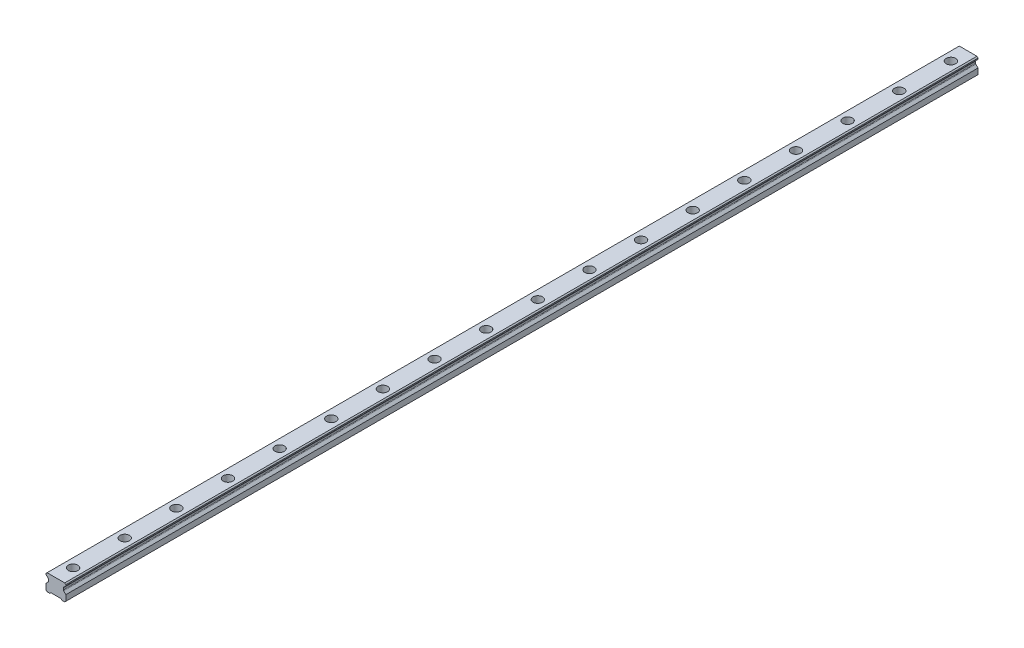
ISO-10303-21;
HEADER;
FILE_DESCRIPTION(('STEP AP214'),'2;1');
FILE_NAME('part.step','',(''),(''),'','','');
FILE_SCHEMA(('AUTOMOTIVE_DESIGN { 1 0 10303 214 1 1 1 1 }'));
ENDSEC;
DATA;
#1=APPLICATION_CONTEXT('core data for automotive mechanical design processes');
#2=APPLICATION_PROTOCOL_DEFINITION('international standard','automotive_design',2000,#1);
#3=PRODUCT_CONTEXT('',#1,'mechanical');
#4=PRODUCT('Part','Part','',(#3));
#5=PRODUCT_RELATED_PRODUCT_CATEGORY('part','',(#4));
#6=PRODUCT_DEFINITION_FORMATION('','',#4);
#7=PRODUCT_DEFINITION_CONTEXT('part definition',#1,'design');
#8=PRODUCT_DEFINITION('design','',#6,#7);
#9=PRODUCT_DEFINITION_SHAPE('','',#8);
#10=(LENGTH_UNIT() NAMED_UNIT(*) SI_UNIT(.MILLI.,.METRE.));
#11=(NAMED_UNIT(*) PLANE_ANGLE_UNIT() SI_UNIT($,.RADIAN.));
#12=(NAMED_UNIT(*) SI_UNIT($,.STERADIAN.) SOLID_ANGLE_UNIT());
#13=UNCERTAINTY_MEASURE_WITH_UNIT(LENGTH_MEASURE(1.E-05),#10,'distance_accuracy_value','');
#14=(GEOMETRIC_REPRESENTATION_CONTEXT(3) GLOBAL_UNCERTAINTY_ASSIGNED_CONTEXT((#13)) GLOBAL_UNIT_ASSIGNED_CONTEXT((#10,
#11,#12)) REPRESENTATION_CONTEXT('',''));
#15=CARTESIAN_POINT('',(0.,0.,0.));
#16=DIRECTION('',(0.,0.,1.));
#17=DIRECTION('',(1.,0.,0.));
#18=AXIS2_PLACEMENT_3D('',#15,#16,#17);
#19=CARTESIAN_POINT('',(0.,10.2,-510.));
#20=DIRECTION('',(0.,1.,0.));
#21=DIRECTION('',(0.,0.,1.));
#22=AXIS2_PLACEMENT_3D('',#19,#20,#21);
#23=PLANE('',#22);
#24=CARTESIAN_POINT('',(0.,10.2,-510.));
#25=DIRECTION('',(0.,1.,0.));
#26=DIRECTION('',(0.,0.,1.));
#27=AXIS2_PLACEMENT_3D('',#24,#25,#26);
#28=CIRCLE('',#27,3.5);
#29=CARTESIAN_POINT('',(0.,10.2,-506.5));
#30=VERTEX_POINT('',#29);
#31=EDGE_CURVE('E485',#30,#30,#28,.T.);
#32=ORIENTED_EDGE('',*,*,#31,.F.);
#33=EDGE_LOOP('',(#32));
#34=FACE_BOUND('',#33,.T.);
#35=CARTESIAN_POINT('',(0.,10.2,-510.));
#36=DIRECTION('',(0.,1.,0.));
#37=DIRECTION('',(0.,0.,1.));
#38=AXIS2_PLACEMENT_3D('',#35,#36,#37);
#39=CIRCLE('',#38,5.5);
#40=CARTESIAN_POINT('',(0.,10.2,-504.5));
#41=VERTEX_POINT('',#40);
#42=EDGE_CURVE('E11',#41,#41,#39,.T.);
#43=ORIENTED_EDGE('',*,*,#42,.T.);
#44=EDGE_LOOP('',(#43));
#45=FACE_BOUND('',#44,.T.);
#46=ADVANCED_FACE('F39',(#34,#45),#23,.T.);
#47=CARTESIAN_POINT('',(0.,10.2,-510.));
#48=DIRECTION('',(0.,1.,0.));
#49=DIRECTION('',(0.,0.,1.));
#50=AXIS2_PLACEMENT_3D('',#47,#48,#49);
#51=CYLINDRICAL_SURFACE('',#50,5.5);
#52=ORIENTED_EDGE('',*,*,#42,.F.);
#53=EDGE_LOOP('',(#52));
#54=FACE_BOUND('',#53,.T.);
#55=CARTESIAN_POINT('',(0.,19.2,-510.));
#56=DIRECTION('',(0.,1.,0.));
#57=DIRECTION('',(0.,0.,1.));
#58=AXIS2_PLACEMENT_3D('',#55,#56,#57);
#59=CIRCLE('',#58,5.5);
#60=CARTESIAN_POINT('',(0.,19.2,-504.5));
#61=VERTEX_POINT('',#60);
#62=EDGE_CURVE('E48',#61,#61,#59,.T.);
#63=ORIENTED_EDGE('',*,*,#62,.T.);
#64=EDGE_LOOP('',(#63));
#65=FACE_BOUND('',#64,.T.);
#66=ADVANCED_FACE('F817',(#54,#65),#51,.F.);
#67=CARTESIAN_POINT('',(0.,10.2,-450.));
#68=DIRECTION('',(0.,1.,0.));
#69=DIRECTION('',(0.,0.,1.));
#70=AXIS2_PLACEMENT_3D('',#67,#68,#69);
#71=PLANE('',#70);
#72=CARTESIAN_POINT('',(0.,10.2,-450.));
#73=DIRECTION('',(0.,1.,0.));
#74=DIRECTION('',(0.,0.,1.));
#75=AXIS2_PLACEMENT_3D('',#72,#73,#74);
#76=CIRCLE('',#75,3.5);
#77=CARTESIAN_POINT('',(0.,10.2,-446.5));
#78=VERTEX_POINT('',#77);
#79=EDGE_CURVE('E490',#78,#78,#76,.T.);
#80=ORIENTED_EDGE('',*,*,#79,.F.);
#81=EDGE_LOOP('',(#80));
#82=FACE_BOUND('',#81,.T.);
#83=CARTESIAN_POINT('',(0.,10.2,-450.));
#84=DIRECTION('',(0.,1.,0.));
#85=DIRECTION('',(0.,0.,1.));
#86=AXIS2_PLACEMENT_3D('',#83,#84,#85);
#87=CIRCLE('',#86,5.5);
#88=CARTESIAN_POINT('',(0.,10.2,-444.5));
#89=VERTEX_POINT('',#88);
#90=EDGE_CURVE('E469',#89,#89,#87,.T.);
#91=ORIENTED_EDGE('',*,*,#90,.T.);
#92=EDGE_LOOP('',(#91));
#93=FACE_BOUND('',#92,.T.);
#94=ADVANCED_FACE('F819',(#82,#93),#71,.T.);
#95=CARTESIAN_POINT('',(0.,10.2,-450.));
#96=DIRECTION('',(0.,1.,0.));
#97=DIRECTION('',(0.,0.,1.));
#98=AXIS2_PLACEMENT_3D('',#95,#96,#97);
#99=CYLINDRICAL_SURFACE('',#98,5.5);
#100=ORIENTED_EDGE('',*,*,#90,.F.);
#101=EDGE_LOOP('',(#100));
#102=FACE_BOUND('',#101,.T.);
#103=CARTESIAN_POINT('',(0.,19.2,-450.));
#104=DIRECTION('',(0.,1.,0.));
#105=DIRECTION('',(0.,0.,1.));
#106=AXIS2_PLACEMENT_3D('',#103,#104,#105);
#107=CIRCLE('',#106,5.5);
#108=CARTESIAN_POINT('',(0.,19.2,-444.5));
#109=VERTEX_POINT('',#108);
#110=EDGE_CURVE('E465',#109,#109,#107,.T.);
#111=ORIENTED_EDGE('',*,*,#110,.T.);
#112=EDGE_LOOP('',(#111));
#113=FACE_BOUND('',#112,.T.);
#114=ADVANCED_FACE('F825',(#102,#113),#99,.F.);
#115=CARTESIAN_POINT('',(0.,10.2,-390.));
#116=DIRECTION('',(0.,1.,0.));
#117=DIRECTION('',(0.,0.,1.));
#118=AXIS2_PLACEMENT_3D('',#115,#116,#117);
#119=PLANE('',#118);
#120=CARTESIAN_POINT('',(0.,10.2,-390.));
#121=DIRECTION('',(0.,1.,0.));
#122=DIRECTION('',(0.,0.,1.));
#123=AXIS2_PLACEMENT_3D('',#120,#121,#122);
#124=CIRCLE('',#123,3.5);
#125=CARTESIAN_POINT('',(0.,10.2,-386.5));
#126=VERTEX_POINT('',#125);
#127=EDGE_CURVE('E495',#126,#126,#124,.T.);
#128=ORIENTED_EDGE('',*,*,#127,.F.);
#129=EDGE_LOOP('',(#128));
#130=FACE_BOUND('',#129,.T.);
#131=CARTESIAN_POINT('',(0.,10.2,-390.));
#132=DIRECTION('',(0.,1.,0.));
#133=DIRECTION('',(0.,0.,1.));
#134=AXIS2_PLACEMENT_3D('',#131,#132,#133);
#135=CIRCLE('',#134,5.5);
#136=CARTESIAN_POINT('',(0.,10.2,-384.5));
#137=VERTEX_POINT('',#136);
#138=EDGE_CURVE('E461',#137,#137,#135,.T.);
#139=ORIENTED_EDGE('',*,*,#138,.T.);
#140=EDGE_LOOP('',(#139));
#141=FACE_BOUND('',#140,.T.);
#142=ADVANCED_FACE('F833',(#130,#141),#119,.T.);
#143=CARTESIAN_POINT('',(0.,10.2,-390.));
#144=DIRECTION('',(0.,1.,0.));
#145=DIRECTION('',(0.,0.,1.));
#146=AXIS2_PLACEMENT_3D('',#143,#144,#145);
#147=CYLINDRICAL_SURFACE('',#146,5.5);
#148=ORIENTED_EDGE('',*,*,#138,.F.);
#149=EDGE_LOOP('',(#148));
#150=FACE_BOUND('',#149,.T.);
#151=CARTESIAN_POINT('',(0.,19.2,-390.));
#152=DIRECTION('',(0.,1.,0.));
#153=DIRECTION('',(0.,0.,1.));
#154=AXIS2_PLACEMENT_3D('',#151,#152,#153);
#155=CIRCLE('',#154,5.5);
#156=CARTESIAN_POINT('',(0.,19.2,-384.5));
#157=VERTEX_POINT('',#156);
#158=EDGE_CURVE('E457',#157,#157,#155,.T.);
#159=ORIENTED_EDGE('',*,*,#158,.T.);
#160=EDGE_LOOP('',(#159));
#161=FACE_BOUND('',#160,.T.);
#162=ADVANCED_FACE('F837',(#150,#161),#147,.F.);
#163=CARTESIAN_POINT('',(0.,10.2,-330.));
#164=DIRECTION('',(0.,1.,0.));
#165=DIRECTION('',(0.,0.,1.));
#166=AXIS2_PLACEMENT_3D('',#163,#164,#165);
#167=PLANE('',#166);
#168=CARTESIAN_POINT('',(0.,10.2,-330.));
#169=DIRECTION('',(0.,1.,0.));
#170=DIRECTION('',(0.,0.,1.));
#171=AXIS2_PLACEMENT_3D('',#168,#169,#170);
#172=CIRCLE('',#171,3.5);
#173=CARTESIAN_POINT('',(0.,10.2,-326.5));
#174=VERTEX_POINT('',#173);
#175=EDGE_CURVE('E500',#174,#174,#172,.T.);
#176=ORIENTED_EDGE('',*,*,#175,.F.);
#177=EDGE_LOOP('',(#176));
#178=FACE_BOUND('',#177,.T.);
#179=CARTESIAN_POINT('',(0.,10.2,-330.));
#180=DIRECTION('',(0.,1.,0.));
#181=DIRECTION('',(0.,0.,1.));
#182=AXIS2_PLACEMENT_3D('',#179,#180,#181);
#183=CIRCLE('',#182,5.5);
#184=CARTESIAN_POINT('',(0.,10.2,-324.5));
#185=VERTEX_POINT('',#184);
#186=EDGE_CURVE('E453',#185,#185,#183,.T.);
#187=ORIENTED_EDGE('',*,*,#186,.T.);
#188=EDGE_LOOP('',(#187));
#189=FACE_BOUND('',#188,.T.);
#190=ADVANCED_FACE('F841',(#178,#189),#167,.T.);
#191=CARTESIAN_POINT('',(0.,10.2,-330.));
#192=DIRECTION('',(0.,1.,0.));
#193=DIRECTION('',(0.,0.,1.));
#194=AXIS2_PLACEMENT_3D('',#191,#192,#193);
#195=CYLINDRICAL_SURFACE('',#194,5.5);
#196=ORIENTED_EDGE('',*,*,#186,.F.);
#197=EDGE_LOOP('',(#196));
#198=FACE_BOUND('',#197,.T.);
#199=CARTESIAN_POINT('',(0.,19.2,-330.));
#200=DIRECTION('',(0.,1.,0.));
#201=DIRECTION('',(0.,0.,1.));
#202=AXIS2_PLACEMENT_3D('',#199,#200,#201);
#203=CIRCLE('',#202,5.5);
#204=CARTESIAN_POINT('',(0.,19.2,-324.5));
#205=VERTEX_POINT('',#204);
#206=EDGE_CURVE('E449',#205,#205,#203,.T.);
#207=ORIENTED_EDGE('',*,*,#206,.T.);
#208=EDGE_LOOP('',(#207));
#209=FACE_BOUND('',#208,.T.);
#210=ADVANCED_FACE('F845',(#198,#209),#195,.F.);
#211=CARTESIAN_POINT('',(0.,10.2,-270.));
#212=DIRECTION('',(0.,1.,0.));
#213=DIRECTION('',(0.,0.,1.));
#214=AXIS2_PLACEMENT_3D('',#211,#212,#213);
#215=PLANE('',#214);
#216=CARTESIAN_POINT('',(0.,10.2,-270.));
#217=DIRECTION('',(0.,1.,0.));
#218=DIRECTION('',(0.,0.,1.));
#219=AXIS2_PLACEMENT_3D('',#216,#217,#218);
#220=CIRCLE('',#219,3.5);
#221=CARTESIAN_POINT('',(0.,10.2,-266.5));
#222=VERTEX_POINT('',#221);
#223=EDGE_CURVE('E505',#222,#222,#220,.T.);
#224=ORIENTED_EDGE('',*,*,#223,.F.);
#225=EDGE_LOOP('',(#224));
#226=FACE_BOUND('',#225,.T.);
#227=CARTESIAN_POINT('',(0.,10.2,-270.));
#228=DIRECTION('',(0.,1.,0.));
#229=DIRECTION('',(0.,0.,1.));
#230=AXIS2_PLACEMENT_3D('',#227,#228,#229);
#231=CIRCLE('',#230,5.5);
#232=CARTESIAN_POINT('',(0.,10.2,-264.5));
#233=VERTEX_POINT('',#232);
#234=EDGE_CURVE('E445',#233,#233,#231,.T.);
#235=ORIENTED_EDGE('',*,*,#234,.T.);
#236=EDGE_LOOP('',(#235));
#237=FACE_BOUND('',#236,.T.);
#238=ADVANCED_FACE('F849',(#226,#237),#215,.T.);
#239=CARTESIAN_POINT('',(0.,10.2,-270.));
#240=DIRECTION('',(0.,1.,0.));
#241=DIRECTION('',(0.,0.,1.));
#242=AXIS2_PLACEMENT_3D('',#239,#240,#241);
#243=CYLINDRICAL_SURFACE('',#242,5.5);
#244=ORIENTED_EDGE('',*,*,#234,.F.);
#245=EDGE_LOOP('',(#244));
#246=FACE_BOUND('',#245,.T.);
#247=CARTESIAN_POINT('',(0.,19.2,-270.));
#248=DIRECTION('',(0.,1.,0.));
#249=DIRECTION('',(0.,0.,1.));
#250=AXIS2_PLACEMENT_3D('',#247,#248,#249);
#251=CIRCLE('',#250,5.5);
#252=CARTESIAN_POINT('',(0.,19.2,-264.5));
#253=VERTEX_POINT('',#252);
#254=EDGE_CURVE('E441',#253,#253,#251,.T.);
#255=ORIENTED_EDGE('',*,*,#254,.T.);
#256=EDGE_LOOP('',(#255));
#257=FACE_BOUND('',#256,.T.);
#258=ADVANCED_FACE('F853',(#246,#257),#243,.F.);
#259=CARTESIAN_POINT('',(0.,10.2,-210.));
#260=DIRECTION('',(0.,1.,0.));
#261=DIRECTION('',(0.,0.,1.));
#262=AXIS2_PLACEMENT_3D('',#259,#260,#261);
#263=PLANE('',#262);
#264=CARTESIAN_POINT('',(0.,10.2,-210.));
#265=DIRECTION('',(0.,1.,0.));
#266=DIRECTION('',(0.,0.,1.));
#267=AXIS2_PLACEMENT_3D('',#264,#265,#266);
#268=CIRCLE('',#267,3.5);
#269=CARTESIAN_POINT('',(0.,10.2,-206.5));
#270=VERTEX_POINT('',#269);
#271=EDGE_CURVE('E510',#270,#270,#268,.T.);
#272=ORIENTED_EDGE('',*,*,#271,.F.);
#273=EDGE_LOOP('',(#272));
#274=FACE_BOUND('',#273,.T.);
#275=CARTESIAN_POINT('',(0.,10.2,-210.));
#276=DIRECTION('',(0.,1.,0.));
#277=DIRECTION('',(0.,0.,1.));
#278=AXIS2_PLACEMENT_3D('',#275,#276,#277);
#279=CIRCLE('',#278,5.5);
#280=CARTESIAN_POINT('',(0.,10.2,-204.5));
#281=VERTEX_POINT('',#280);
#282=EDGE_CURVE('E437',#281,#281,#279,.T.);
#283=ORIENTED_EDGE('',*,*,#282,.T.);
#284=EDGE_LOOP('',(#283));
#285=FACE_BOUND('',#284,.T.);
#286=ADVANCED_FACE('F857',(#274,#285),#263,.T.);
#287=CARTESIAN_POINT('',(0.,10.2,-210.));
#288=DIRECTION('',(0.,1.,0.));
#289=DIRECTION('',(0.,0.,1.));
#290=AXIS2_PLACEMENT_3D('',#287,#288,#289);
#291=CYLINDRICAL_SURFACE('',#290,5.5);
#292=ORIENTED_EDGE('',*,*,#282,.F.);
#293=EDGE_LOOP('',(#292));
#294=FACE_BOUND('',#293,.T.);
#295=CARTESIAN_POINT('',(0.,19.2,-210.));
#296=DIRECTION('',(0.,1.,0.));
#297=DIRECTION('',(0.,0.,1.));
#298=AXIS2_PLACEMENT_3D('',#295,#296,#297);
#299=CIRCLE('',#298,5.5);
#300=CARTESIAN_POINT('',(0.,19.2,-204.5));
#301=VERTEX_POINT('',#300);
#302=EDGE_CURVE('E433',#301,#301,#299,.T.);
#303=ORIENTED_EDGE('',*,*,#302,.T.);
#304=EDGE_LOOP('',(#303));
#305=FACE_BOUND('',#304,.T.);
#306=ADVANCED_FACE('F861',(#294,#305),#291,.F.);
#307=CARTESIAN_POINT('',(0.,10.2,-150.));
#308=DIRECTION('',(0.,1.,0.));
#309=DIRECTION('',(0.,0.,1.));
#310=AXIS2_PLACEMENT_3D('',#307,#308,#309);
#311=PLANE('',#310);
#312=CARTESIAN_POINT('',(0.,10.2,-150.));
#313=DIRECTION('',(0.,1.,0.));
#314=DIRECTION('',(0.,0.,1.));
#315=AXIS2_PLACEMENT_3D('',#312,#313,#314);
#316=CIRCLE('',#315,3.5);
#317=CARTESIAN_POINT('',(0.,10.2,-146.5));
#318=VERTEX_POINT('',#317);
#319=EDGE_CURVE('E515',#318,#318,#316,.T.);
#320=ORIENTED_EDGE('',*,*,#319,.F.);
#321=EDGE_LOOP('',(#320));
#322=FACE_BOUND('',#321,.T.);
#323=CARTESIAN_POINT('',(0.,10.2,-150.));
#324=DIRECTION('',(0.,1.,0.));
#325=DIRECTION('',(0.,0.,1.));
#326=AXIS2_PLACEMENT_3D('',#323,#324,#325);
#327=CIRCLE('',#326,5.5);
#328=CARTESIAN_POINT('',(0.,10.2,-144.5));
#329=VERTEX_POINT('',#328);
#330=EDGE_CURVE('E429',#329,#329,#327,.T.);
#331=ORIENTED_EDGE('',*,*,#330,.T.);
#332=EDGE_LOOP('',(#331));
#333=FACE_BOUND('',#332,.T.);
#334=ADVANCED_FACE('F865',(#322,#333),#311,.T.);
#335=CARTESIAN_POINT('',(0.,10.2,-150.));
#336=DIRECTION('',(0.,1.,0.));
#337=DIRECTION('',(0.,0.,1.));
#338=AXIS2_PLACEMENT_3D('',#335,#336,#337);
#339=CYLINDRICAL_SURFACE('',#338,5.5);
#340=ORIENTED_EDGE('',*,*,#330,.F.);
#341=EDGE_LOOP('',(#340));
#342=FACE_BOUND('',#341,.T.);
#343=CARTESIAN_POINT('',(0.,19.2,-150.));
#344=DIRECTION('',(0.,1.,0.));
#345=DIRECTION('',(0.,0.,1.));
#346=AXIS2_PLACEMENT_3D('',#343,#344,#345);
#347=CIRCLE('',#346,5.5);
#348=CARTESIAN_POINT('',(0.,19.2,-144.5));
#349=VERTEX_POINT('',#348);
#350=EDGE_CURVE('E425',#349,#349,#347,.T.);
#351=ORIENTED_EDGE('',*,*,#350,.T.);
#352=EDGE_LOOP('',(#351));
#353=FACE_BOUND('',#352,.T.);
#354=ADVANCED_FACE('F869',(#342,#353),#339,.F.);
#355=CARTESIAN_POINT('',(0.,10.2,-90.));
#356=DIRECTION('',(0.,1.,0.));
#357=DIRECTION('',(0.,0.,1.));
#358=AXIS2_PLACEMENT_3D('',#355,#356,#357);
#359=PLANE('',#358);
#360=CARTESIAN_POINT('',(0.,10.2,-90.));
#361=DIRECTION('',(0.,1.,0.));
#362=DIRECTION('',(0.,0.,1.));
#363=AXIS2_PLACEMENT_3D('',#360,#361,#362);
#364=CIRCLE('',#363,3.5);
#365=CARTESIAN_POINT('',(0.,10.2,-86.5));
#366=VERTEX_POINT('',#365);
#367=EDGE_CURVE('E520',#366,#366,#364,.T.);
#368=ORIENTED_EDGE('',*,*,#367,.F.);
#369=EDGE_LOOP('',(#368));
#370=FACE_BOUND('',#369,.T.);
#371=CARTESIAN_POINT('',(0.,10.2,-90.));
#372=DIRECTION('',(0.,1.,0.));
#373=DIRECTION('',(0.,0.,1.));
#374=AXIS2_PLACEMENT_3D('',#371,#372,#373);
#375=CIRCLE('',#374,5.5);
#376=CARTESIAN_POINT('',(0.,10.2,-84.5));
#377=VERTEX_POINT('',#376);
#378=EDGE_CURVE('E421',#377,#377,#375,.T.);
#379=ORIENTED_EDGE('',*,*,#378,.T.);
#380=EDGE_LOOP('',(#379));
#381=FACE_BOUND('',#380,.T.);
#382=ADVANCED_FACE('F873',(#370,#381),#359,.T.);
#383=CARTESIAN_POINT('',(0.,10.2,-90.));
#384=DIRECTION('',(0.,1.,0.));
#385=DIRECTION('',(0.,0.,1.));
#386=AXIS2_PLACEMENT_3D('',#383,#384,#385);
#387=CYLINDRICAL_SURFACE('',#386,5.5);
#388=ORIENTED_EDGE('',*,*,#378,.F.);
#389=EDGE_LOOP('',(#388));
#390=FACE_BOUND('',#389,.T.);
#391=CARTESIAN_POINT('',(0.,19.2,-90.));
#392=DIRECTION('',(0.,1.,0.));
#393=DIRECTION('',(0.,0.,1.));
#394=AXIS2_PLACEMENT_3D('',#391,#392,#393);
#395=CIRCLE('',#394,5.5);
#396=CARTESIAN_POINT('',(0.,19.2,-84.5));
#397=VERTEX_POINT('',#396);
#398=EDGE_CURVE('E417',#397,#397,#395,.T.);
#399=ORIENTED_EDGE('',*,*,#398,.T.);
#400=EDGE_LOOP('',(#399));
#401=FACE_BOUND('',#400,.T.);
#402=ADVANCED_FACE('F877',(#390,#401),#387,.F.);
#403=CARTESIAN_POINT('',(0.,10.2,-30.));
#404=DIRECTION('',(0.,1.,0.));
#405=DIRECTION('',(0.,0.,1.));
#406=AXIS2_PLACEMENT_3D('',#403,#404,#405);
#407=PLANE('',#406);
#408=CARTESIAN_POINT('',(0.,10.2,-30.));
#409=DIRECTION('',(0.,1.,0.));
#410=DIRECTION('',(0.,0.,1.));
#411=AXIS2_PLACEMENT_3D('',#408,#409,#410);
#412=CIRCLE('',#411,3.5);
#413=CARTESIAN_POINT('',(0.,10.2,-26.5));
#414=VERTEX_POINT('',#413);
#415=EDGE_CURVE('E525',#414,#414,#412,.T.);
#416=ORIENTED_EDGE('',*,*,#415,.F.);
#417=EDGE_LOOP('',(#416));
#418=FACE_BOUND('',#417,.T.);
#419=CARTESIAN_POINT('',(0.,10.2,-30.));
#420=DIRECTION('',(0.,1.,0.));
#421=DIRECTION('',(0.,0.,1.));
#422=AXIS2_PLACEMENT_3D('',#419,#420,#421);
#423=CIRCLE('',#422,5.5);
#424=CARTESIAN_POINT('',(0.,10.2,-24.5));
#425=VERTEX_POINT('',#424);
#426=EDGE_CURVE('E413',#425,#425,#423,.T.);
#427=ORIENTED_EDGE('',*,*,#426,.T.);
#428=EDGE_LOOP('',(#427));
#429=FACE_BOUND('',#428,.T.);
#430=ADVANCED_FACE('F881',(#418,#429),#407,.T.);
#431=CARTESIAN_POINT('',(0.,10.2,-30.));
#432=DIRECTION('',(0.,1.,0.));
#433=DIRECTION('',(0.,0.,1.));
#434=AXIS2_PLACEMENT_3D('',#431,#432,#433);
#435=CYLINDRICAL_SURFACE('',#434,5.5);
#436=ORIENTED_EDGE('',*,*,#426,.F.);
#437=EDGE_LOOP('',(#436));
#438=FACE_BOUND('',#437,.T.);
#439=CARTESIAN_POINT('',(0.,19.2,-30.));
#440=DIRECTION('',(0.,1.,0.));
#441=DIRECTION('',(0.,0.,1.));
#442=AXIS2_PLACEMENT_3D('',#439,#440,#441);
#443=CIRCLE('',#442,5.5);
#444=CARTESIAN_POINT('',(0.,19.2,-24.5));
#445=VERTEX_POINT('',#444);
#446=EDGE_CURVE('E409',#445,#445,#443,.T.);
#447=ORIENTED_EDGE('',*,*,#446,.T.);
#448=EDGE_LOOP('',(#447));
#449=FACE_BOUND('',#448,.T.);
#450=ADVANCED_FACE('F885',(#438,#449),#435,.F.);
#451=CARTESIAN_POINT('',(0.,10.2,30.));
#452=DIRECTION('',(0.,1.,0.));
#453=DIRECTION('',(0.,0.,1.));
#454=AXIS2_PLACEMENT_3D('',#451,#452,#453);
#455=PLANE('',#454);
#456=CARTESIAN_POINT('',(0.,10.2,30.));
#457=DIRECTION('',(0.,1.,0.));
#458=DIRECTION('',(0.,0.,1.));
#459=AXIS2_PLACEMENT_3D('',#456,#457,#458);
#460=CIRCLE('',#459,3.5);
#461=CARTESIAN_POINT('',(0.,10.2,33.5));
#462=VERTEX_POINT('',#461);
#463=EDGE_CURVE('E530',#462,#462,#460,.T.);
#464=ORIENTED_EDGE('',*,*,#463,.F.);
#465=EDGE_LOOP('',(#464));
#466=FACE_BOUND('',#465,.T.);
#467=CARTESIAN_POINT('',(0.,10.2,30.));
#468=DIRECTION('',(0.,1.,0.));
#469=DIRECTION('',(0.,0.,1.));
#470=AXIS2_PLACEMENT_3D('',#467,#468,#469);
#471=CIRCLE('',#470,5.5);
#472=CARTESIAN_POINT('',(0.,10.2,35.5));
#473=VERTEX_POINT('',#472);
#474=EDGE_CURVE('E405',#473,#473,#471,.T.);
#475=ORIENTED_EDGE('',*,*,#474,.T.);
#476=EDGE_LOOP('',(#475));
#477=FACE_BOUND('',#476,.T.);
#478=ADVANCED_FACE('F889',(#466,#477),#455,.T.);
#479=CARTESIAN_POINT('',(0.,10.2,30.));
#480=DIRECTION('',(0.,1.,0.));
#481=DIRECTION('',(0.,0.,1.));
#482=AXIS2_PLACEMENT_3D('',#479,#480,#481);
#483=CYLINDRICAL_SURFACE('',#482,5.5);
#484=ORIENTED_EDGE('',*,*,#474,.F.);
#485=EDGE_LOOP('',(#484));
#486=FACE_BOUND('',#485,.T.);
#487=CARTESIAN_POINT('',(0.,19.2,30.));
#488=DIRECTION('',(0.,1.,0.));
#489=DIRECTION('',(0.,0.,1.));
#490=AXIS2_PLACEMENT_3D('',#487,#488,#489);
#491=CIRCLE('',#490,5.5);
#492=CARTESIAN_POINT('',(0.,19.2,35.5));
#493=VERTEX_POINT('',#492);
#494=EDGE_CURVE('E401',#493,#493,#491,.T.);
#495=ORIENTED_EDGE('',*,*,#494,.T.);
#496=EDGE_LOOP('',(#495));
#497=FACE_BOUND('',#496,.T.);
#498=ADVANCED_FACE('F893',(#486,#497),#483,.F.);
#499=CARTESIAN_POINT('',(0.,10.2,90.));
#500=DIRECTION('',(0.,1.,0.));
#501=DIRECTION('',(0.,0.,1.));
#502=AXIS2_PLACEMENT_3D('',#499,#500,#501);
#503=PLANE('',#502);
#504=CARTESIAN_POINT('',(0.,10.2,90.));
#505=DIRECTION('',(0.,1.,0.));
#506=DIRECTION('',(0.,0.,1.));
#507=AXIS2_PLACEMENT_3D('',#504,#505,#506);
#508=CIRCLE('',#507,3.5);
#509=CARTESIAN_POINT('',(0.,10.2,93.5));
#510=VERTEX_POINT('',#509);
#511=EDGE_CURVE('E535',#510,#510,#508,.T.);
#512=ORIENTED_EDGE('',*,*,#511,.F.);
#513=EDGE_LOOP('',(#512));
#514=FACE_BOUND('',#513,.T.);
#515=CARTESIAN_POINT('',(0.,10.2,90.));
#516=DIRECTION('',(0.,1.,0.));
#517=DIRECTION('',(0.,0.,1.));
#518=AXIS2_PLACEMENT_3D('',#515,#516,#517);
#519=CIRCLE('',#518,5.5);
#520=CARTESIAN_POINT('',(0.,10.2,95.5));
#521=VERTEX_POINT('',#520);
#522=EDGE_CURVE('E397',#521,#521,#519,.T.);
#523=ORIENTED_EDGE('',*,*,#522,.T.);
#524=EDGE_LOOP('',(#523));
#525=FACE_BOUND('',#524,.T.);
#526=ADVANCED_FACE('F897',(#514,#525),#503,.T.);
#527=CARTESIAN_POINT('',(0.,10.2,90.));
#528=DIRECTION('',(0.,1.,0.));
#529=DIRECTION('',(0.,0.,1.));
#530=AXIS2_PLACEMENT_3D('',#527,#528,#529);
#531=CYLINDRICAL_SURFACE('',#530,5.5);
#532=ORIENTED_EDGE('',*,*,#522,.F.);
#533=EDGE_LOOP('',(#532));
#534=FACE_BOUND('',#533,.T.);
#535=CARTESIAN_POINT('',(0.,19.2,90.));
#536=DIRECTION('',(0.,1.,0.));
#537=DIRECTION('',(0.,0.,1.));
#538=AXIS2_PLACEMENT_3D('',#535,#536,#537);
#539=CIRCLE('',#538,5.5);
#540=CARTESIAN_POINT('',(0.,19.2,95.5));
#541=VERTEX_POINT('',#540);
#542=EDGE_CURVE('E393',#541,#541,#539,.T.);
#543=ORIENTED_EDGE('',*,*,#542,.T.);
#544=EDGE_LOOP('',(#543));
#545=FACE_BOUND('',#544,.T.);
#546=ADVANCED_FACE('F779',(#534,#545),#531,.F.);
#547=CARTESIAN_POINT('',(0.,10.2,150.));
#548=DIRECTION('',(0.,1.,0.));
#549=DIRECTION('',(0.,0.,1.));
#550=AXIS2_PLACEMENT_3D('',#547,#548,#549);
#551=PLANE('',#550);
#552=CARTESIAN_POINT('',(0.,10.2,150.));
#553=DIRECTION('',(0.,1.,0.));
#554=DIRECTION('',(0.,0.,1.));
#555=AXIS2_PLACEMENT_3D('',#552,#553,#554);
#556=CIRCLE('',#555,3.5);
#557=CARTESIAN_POINT('',(0.,10.2,153.5));
#558=VERTEX_POINT('',#557);
#559=EDGE_CURVE('E540',#558,#558,#556,.T.);
#560=ORIENTED_EDGE('',*,*,#559,.F.);
#561=EDGE_LOOP('',(#560));
#562=FACE_BOUND('',#561,.T.);
#563=CARTESIAN_POINT('',(0.,10.2,150.));
#564=DIRECTION('',(0.,1.,0.));
#565=DIRECTION('',(0.,0.,1.));
#566=AXIS2_PLACEMENT_3D('',#563,#564,#565);
#567=CIRCLE('',#566,5.5);
#568=CARTESIAN_POINT('',(0.,10.2,155.5));
#569=VERTEX_POINT('',#568);
#570=EDGE_CURVE('E389',#569,#569,#567,.T.);
#571=ORIENTED_EDGE('',*,*,#570,.T.);
#572=EDGE_LOOP('',(#571));
#573=FACE_BOUND('',#572,.T.);
#574=ADVANCED_FACE('F775',(#562,#573),#551,.T.);
#575=CARTESIAN_POINT('',(0.,10.2,150.));
#576=DIRECTION('',(0.,1.,0.));
#577=DIRECTION('',(0.,0.,1.));
#578=AXIS2_PLACEMENT_3D('',#575,#576,#577);
#579=CYLINDRICAL_SURFACE('',#578,5.5);
#580=ORIENTED_EDGE('',*,*,#570,.F.);
#581=EDGE_LOOP('',(#580));
#582=FACE_BOUND('',#581,.T.);
#583=CARTESIAN_POINT('',(0.,19.2,150.));
#584=DIRECTION('',(0.,1.,0.));
#585=DIRECTION('',(0.,0.,1.));
#586=AXIS2_PLACEMENT_3D('',#583,#584,#585);
#587=CIRCLE('',#586,5.5);
#588=CARTESIAN_POINT('',(0.,19.2,155.5));
#589=VERTEX_POINT('',#588);
#590=EDGE_CURVE('E385',#589,#589,#587,.T.);
#591=ORIENTED_EDGE('',*,*,#590,.T.);
#592=EDGE_LOOP('',(#591));
#593=FACE_BOUND('',#592,.T.);
#594=ADVANCED_FACE('F778',(#582,#593),#579,.F.);
#595=CARTESIAN_POINT('',(0.,10.2,210.));
#596=DIRECTION('',(0.,1.,0.));
#597=DIRECTION('',(0.,0.,1.));
#598=AXIS2_PLACEMENT_3D('',#595,#596,#597);
#599=PLANE('',#598);
#600=CARTESIAN_POINT('',(0.,10.2,210.));
#601=DIRECTION('',(0.,1.,0.));
#602=DIRECTION('',(0.,0.,1.));
#603=AXIS2_PLACEMENT_3D('',#600,#601,#602);
#604=CIRCLE('',#603,3.5);
#605=CARTESIAN_POINT('',(0.,10.2,213.5));
#606=VERTEX_POINT('',#605);
#607=EDGE_CURVE('E545',#606,#606,#604,.T.);
#608=ORIENTED_EDGE('',*,*,#607,.F.);
#609=EDGE_LOOP('',(#608));
#610=FACE_BOUND('',#609,.T.);
#611=CARTESIAN_POINT('',(0.,10.2,210.));
#612=DIRECTION('',(0.,1.,0.));
#613=DIRECTION('',(0.,0.,1.));
#614=AXIS2_PLACEMENT_3D('',#611,#612,#613);
#615=CIRCLE('',#614,5.5);
#616=CARTESIAN_POINT('',(0.,10.2,215.5));
#617=VERTEX_POINT('',#616);
#618=EDGE_CURVE('E381',#617,#617,#615,.T.);
#619=ORIENTED_EDGE('',*,*,#618,.T.);
#620=EDGE_LOOP('',(#619));
#621=FACE_BOUND('',#620,.T.);
#622=ADVANCED_FACE('F785',(#610,#621),#599,.T.);
#623=CARTESIAN_POINT('',(0.,10.2,210.));
#624=DIRECTION('',(0.,1.,0.));
#625=DIRECTION('',(0.,0.,1.));
#626=AXIS2_PLACEMENT_3D('',#623,#624,#625);
#627=CYLINDRICAL_SURFACE('',#626,5.5);
#628=ORIENTED_EDGE('',*,*,#618,.F.);
#629=EDGE_LOOP('',(#628));
#630=FACE_BOUND('',#629,.T.);
#631=CARTESIAN_POINT('',(0.,19.2,210.));
#632=DIRECTION('',(0.,1.,0.));
#633=DIRECTION('',(0.,0.,1.));
#634=AXIS2_PLACEMENT_3D('',#631,#632,#633);
#635=CIRCLE('',#634,5.5);
#636=CARTESIAN_POINT('',(0.,19.2,215.5));
#637=VERTEX_POINT('',#636);
#638=EDGE_CURVE('E377',#637,#637,#635,.T.);
#639=ORIENTED_EDGE('',*,*,#638,.T.);
#640=EDGE_LOOP('',(#639));
#641=FACE_BOUND('',#640,.T.);
#642=ADVANCED_FACE('F907',(#630,#641),#627,.F.);
#643=CARTESIAN_POINT('',(0.,10.2,270.));
#644=DIRECTION('',(0.,1.,0.));
#645=DIRECTION('',(0.,0.,1.));
#646=AXIS2_PLACEMENT_3D('',#643,#644,#645);
#647=PLANE('',#646);
#648=CARTESIAN_POINT('',(0.,10.2,270.));
#649=DIRECTION('',(0.,1.,0.));
#650=DIRECTION('',(0.,0.,1.));
#651=AXIS2_PLACEMENT_3D('',#648,#649,#650);
#652=CIRCLE('',#651,3.5);
#653=CARTESIAN_POINT('',(0.,10.2,273.5));
#654=VERTEX_POINT('',#653);
#655=EDGE_CURVE('E549',#654,#654,#652,.T.);
#656=ORIENTED_EDGE('',*,*,#655,.F.);
#657=EDGE_LOOP('',(#656));
#658=FACE_BOUND('',#657,.T.);
#659=CARTESIAN_POINT('',(0.,10.2,270.));
#660=DIRECTION('',(0.,1.,0.));
#661=DIRECTION('',(0.,0.,1.));
#662=AXIS2_PLACEMENT_3D('',#659,#660,#661);
#663=CIRCLE('',#662,5.5);
#664=CARTESIAN_POINT('',(0.,10.2,275.5));
#665=VERTEX_POINT('',#664);
#666=EDGE_CURVE('E373',#665,#665,#663,.T.);
#667=ORIENTED_EDGE('',*,*,#666,.T.);
#668=EDGE_LOOP('',(#667));
#669=FACE_BOUND('',#668,.T.);
#670=ADVANCED_FACE('F911',(#658,#669),#647,.T.);
#671=CARTESIAN_POINT('',(0.,10.2,270.));
#672=DIRECTION('',(0.,1.,0.));
#673=DIRECTION('',(0.,0.,1.));
#674=AXIS2_PLACEMENT_3D('',#671,#672,#673);
#675=CYLINDRICAL_SURFACE('',#674,5.5);
#676=ORIENTED_EDGE('',*,*,#666,.F.);
#677=EDGE_LOOP('',(#676));
#678=FACE_BOUND('',#677,.T.);
#679=CARTESIAN_POINT('',(0.,19.2,270.));
#680=DIRECTION('',(0.,1.,0.));
#681=DIRECTION('',(0.,0.,1.));
#682=AXIS2_PLACEMENT_3D('',#679,#680,#681);
#683=CIRCLE('',#682,5.5);
#684=CARTESIAN_POINT('',(0.,19.2,275.5));
#685=VERTEX_POINT('',#684);
#686=EDGE_CURVE('E369',#685,#685,#683,.T.);
#687=ORIENTED_EDGE('',*,*,#686,.T.);
#688=EDGE_LOOP('',(#687));
#689=FACE_BOUND('',#688,.T.);
#690=ADVANCED_FACE('F915',(#678,#689),#675,.F.);
#691=CARTESIAN_POINT('',(0.,10.2,330.));
#692=DIRECTION('',(0.,1.,0.));
#693=DIRECTION('',(0.,0.,1.));
#694=AXIS2_PLACEMENT_3D('',#691,#692,#693);
#695=PLANE('',#694);
#696=CARTESIAN_POINT('',(0.,10.2,330.));
#697=DIRECTION('',(0.,1.,0.));
#698=DIRECTION('',(0.,0.,1.));
#699=AXIS2_PLACEMENT_3D('',#696,#697,#698);
#700=CIRCLE('',#699,3.5);
#701=CARTESIAN_POINT('',(0.,10.2,333.5));
#702=VERTEX_POINT('',#701);
#703=EDGE_CURVE('E553',#702,#702,#700,.T.);
#704=ORIENTED_EDGE('',*,*,#703,.F.);
#705=EDGE_LOOP('',(#704));
#706=FACE_BOUND('',#705,.T.);
#707=CARTESIAN_POINT('',(0.,10.2,330.));
#708=DIRECTION('',(0.,1.,0.));
#709=DIRECTION('',(0.,0.,1.));
#710=AXIS2_PLACEMENT_3D('',#707,#708,#709);
#711=CIRCLE('',#710,5.5);
#712=CARTESIAN_POINT('',(0.,10.2,335.5));
#713=VERTEX_POINT('',#712);
#714=EDGE_CURVE('E365',#713,#713,#711,.T.);
#715=ORIENTED_EDGE('',*,*,#714,.T.);
#716=EDGE_LOOP('',(#715));
#717=FACE_BOUND('',#716,.T.);
#718=ADVANCED_FACE('F919',(#706,#717),#695,.T.);
#719=CARTESIAN_POINT('',(0.,10.2,330.));
#720=DIRECTION('',(0.,1.,0.));
#721=DIRECTION('',(0.,0.,1.));
#722=AXIS2_PLACEMENT_3D('',#719,#720,#721);
#723=CYLINDRICAL_SURFACE('',#722,5.5);
#724=ORIENTED_EDGE('',*,*,#714,.F.);
#725=EDGE_LOOP('',(#724));
#726=FACE_BOUND('',#725,.T.);
#727=CARTESIAN_POINT('',(0.,19.2,330.));
#728=DIRECTION('',(0.,1.,0.));
#729=DIRECTION('',(0.,0.,1.));
#730=AXIS2_PLACEMENT_3D('',#727,#728,#729);
#731=CIRCLE('',#730,5.5);
#732=CARTESIAN_POINT('',(0.,19.2,335.5));
#733=VERTEX_POINT('',#732);
#734=EDGE_CURVE('E361',#733,#733,#731,.T.);
#735=ORIENTED_EDGE('',*,*,#734,.T.);
#736=EDGE_LOOP('',(#735));
#737=FACE_BOUND('',#736,.T.);
#738=ADVANCED_FACE('F923',(#726,#737),#723,.F.);
#739=CARTESIAN_POINT('',(0.,10.2,390.));
#740=DIRECTION('',(0.,1.,0.));
#741=DIRECTION('',(0.,0.,1.));
#742=AXIS2_PLACEMENT_3D('',#739,#740,#741);
#743=PLANE('',#742);
#744=CARTESIAN_POINT('',(0.,10.2,390.));
#745=DIRECTION('',(0.,1.,0.));
#746=DIRECTION('',(0.,0.,1.));
#747=AXIS2_PLACEMENT_3D('',#744,#745,#746);
#748=CIRCLE('',#747,3.5);
#749=CARTESIAN_POINT('',(0.,10.2,393.5));
#750=VERTEX_POINT('',#749);
#751=EDGE_CURVE('E568',#750,#750,#748,.T.);
#752=ORIENTED_EDGE('',*,*,#751,.F.);
#753=EDGE_LOOP('',(#752));
#754=FACE_BOUND('',#753,.T.);
#755=CARTESIAN_POINT('',(0.,10.2,390.));
#756=DIRECTION('',(0.,1.,0.));
#757=DIRECTION('',(0.,0.,1.));
#758=AXIS2_PLACEMENT_3D('',#755,#756,#757);
#759=CIRCLE('',#758,5.5);
#760=CARTESIAN_POINT('',(0.,10.2,395.5));
#761=VERTEX_POINT('',#760);
#762=EDGE_CURVE('E357',#761,#761,#759,.T.);
#763=ORIENTED_EDGE('',*,*,#762,.T.);
#764=EDGE_LOOP('',(#763));
#765=FACE_BOUND('',#764,.T.);
#766=ADVANCED_FACE('F927',(#754,#765),#743,.T.);
#767=CARTESIAN_POINT('',(0.,10.2,390.));
#768=DIRECTION('',(0.,1.,0.));
#769=DIRECTION('',(0.,0.,1.));
#770=AXIS2_PLACEMENT_3D('',#767,#768,#769);
#771=CYLINDRICAL_SURFACE('',#770,5.5);
#772=ORIENTED_EDGE('',*,*,#762,.F.);
#773=EDGE_LOOP('',(#772));
#774=FACE_BOUND('',#773,.T.);
#775=CARTESIAN_POINT('',(0.,19.2,390.));
#776=DIRECTION('',(0.,1.,0.));
#777=DIRECTION('',(0.,0.,1.));
#778=AXIS2_PLACEMENT_3D('',#775,#776,#777);
#779=CIRCLE('',#778,5.5);
#780=CARTESIAN_POINT('',(0.,19.2,395.5));
#781=VERTEX_POINT('',#780);
#782=EDGE_CURVE('E353',#781,#781,#779,.T.);
#783=ORIENTED_EDGE('',*,*,#782,.T.);
#784=EDGE_LOOP('',(#783));
#785=FACE_BOUND('',#784,.T.);
#786=ADVANCED_FACE('F931',(#774,#785),#771,.F.);
#787=CARTESIAN_POINT('',(11.5,0.,530.));
#788=DIRECTION('',(0.,1.,0.));
#789=DIRECTION('',(-1.,0.,0.));
#790=AXIS2_PLACEMENT_3D('',#787,#788,#789);
#791=PLANE('',#790);
#792=DIRECTION('',(1.,0.,0.));
#793=VECTOR('',#792,1.);
#794=CARTESIAN_POINT('',(11.5,0.,-530.));
#795=LINE('',#794,#793);
#796=CARTESIAN_POINT('',(-10.25,0.,-530.));
#797=VERTEX_POINT('',#796);
#798=CARTESIAN_POINT('',(-7.,0.,-530.));
#799=VERTEX_POINT('',#798);
#800=EDGE_CURVE('E229',#797,#799,#795,.T.);
#801=ORIENTED_EDGE('',*,*,#800,.T.);
#802=DIRECTION('',(0.,0.,1.));
#803=VECTOR('',#802,1.);
#804=CARTESIAN_POINT('',(-7.,0.,-530.));
#805=LINE('',#804,#803);
#806=CARTESIAN_POINT('',(-7.,0.,530.));
#807=VERTEX_POINT('',#806);
#808=EDGE_CURVE('E609',#799,#807,#805,.T.);
#809=ORIENTED_EDGE('',*,*,#808,.T.);
#810=DIRECTION('',(1.,0.,0.));
#811=VECTOR('',#810,1.);
#812=CARTESIAN_POINT('',(11.5,0.,530.));
#813=LINE('',#812,#811);
#814=CARTESIAN_POINT('',(-10.25,0.,530.));
#815=VERTEX_POINT('',#814);
#816=EDGE_CURVE('E678',#815,#807,#813,.T.);
#817=ORIENTED_EDGE('',*,*,#816,.F.);
#818=DIRECTION('',(0.,0.,-1.));
#819=VECTOR('',#818,1.);
#820=CARTESIAN_POINT('',(-10.25,0.,530.));
#821=LINE('',#820,#819);
#822=EDGE_CURVE('E289',#815,#797,#821,.T.);
#823=ORIENTED_EDGE('',*,*,#822,.T.);
#824=EDGE_LOOP('',(#801,#809,#817,#823));
#825=FACE_BOUND('',#824,.T.);
#826=ADVANCED_FACE('F935',(#825),#791,.F.);
#827=CARTESIAN_POINT('',(-11.5,19.2,530.));
#828=DIRECTION('',(1.,0.,0.));
#829=DIRECTION('',(0.,1.,0.));
#830=AXIS2_PLACEMENT_3D('',#827,#828,#829);
#831=PLANE('',#830);
#832=DIRECTION('',(0.,-1.,0.));
#833=VECTOR('',#832,1.);
#834=CARTESIAN_POINT('',(-11.5,19.2,530.));
#835=LINE('',#834,#833);
#836=CARTESIAN_POINT('',(-11.5,17.95,530.));
#837=VERTEX_POINT('',#836);
#838=CARTESIAN_POINT('',(-11.5,16.7,530.));
#839=VERTEX_POINT('',#838);
#840=EDGE_CURVE('E674',#837,#839,#835,.T.);
#841=ORIENTED_EDGE('',*,*,#840,.F.);
#842=DIRECTION('',(0.,0.,-1.));
#843=VECTOR('',#842,1.);
#844=CARTESIAN_POINT('',(-11.5,17.95,530.));
#845=LINE('',#844,#843);
#846=CARTESIAN_POINT('',(-11.5,17.95,-530.));
#847=VERTEX_POINT('',#846);
#848=EDGE_CURVE('E251',#837,#847,#845,.T.);
#849=ORIENTED_EDGE('',*,*,#848,.T.);
#850=DIRECTION('',(0.,-1.,0.));
#851=VECTOR('',#850,1.);
#852=CARTESIAN_POINT('',(-11.5,19.2,-530.));
#853=LINE('',#852,#851);
#854=CARTESIAN_POINT('',(-11.5,16.7,-530.));
#855=VERTEX_POINT('',#854);
#856=EDGE_CURVE('E230',#847,#855,#853,.T.);
#857=ORIENTED_EDGE('',*,*,#856,.T.);
#858=DIRECTION('',(0.,0.,1.));
#859=VECTOR('',#858,1.);
#860=CARTESIAN_POINT('',(-11.5,16.7,-530.));
#861=LINE('',#860,#859);
#862=EDGE_CURVE('E630',#855,#839,#861,.T.);
#863=ORIENTED_EDGE('',*,*,#862,.T.);
#864=EDGE_LOOP('',(#841,#849,#857,#863));
#865=FACE_BOUND('',#864,.T.);
#866=ADVANCED_FACE('F703',(#865),#831,.F.);
#867=CARTESIAN_POINT('',(11.5,19.2,530.));
#868=DIRECTION('',(-1.,0.,0.));
#869=DIRECTION('',(0.,0.,1.));
#870=AXIS2_PLACEMENT_3D('',#867,#868,#869);
#871=PLANE('',#870);
#872=DIRECTION('',(0.,1.,0.));
#873=VECTOR('',#872,1.);
#874=CARTESIAN_POINT('',(11.5,19.2,530.));
#875=LINE('',#874,#873);
#876=CARTESIAN_POINT('',(11.5,1.24999999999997,530.));
#877=VERTEX_POINT('',#876);
#878=CARTESIAN_POINT('',(11.5,7.95,530.));
#879=VERTEX_POINT('',#878);
#880=EDGE_CURVE('E683',#877,#879,#875,.T.);
#881=ORIENTED_EDGE('',*,*,#880,.F.);
#882=DIRECTION('',(0.,0.,-1.));
#883=VECTOR('',#882,1.);
#884=CARTESIAN_POINT('',(11.5,1.24999999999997,530.));
#885=LINE('',#884,#883);
#886=CARTESIAN_POINT('',(11.5,1.24999999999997,-530.));
#887=VERTEX_POINT('',#886);
#888=EDGE_CURVE('E296',#877,#887,#885,.T.);
#889=ORIENTED_EDGE('',*,*,#888,.T.);
#890=DIRECTION('',(0.,1.,0.));
#891=VECTOR('',#890,1.);
#892=CARTESIAN_POINT('',(11.5,19.2,-530.));
#893=LINE('',#892,#891);
#894=CARTESIAN_POINT('',(11.5,7.95,-530.));
#895=VERTEX_POINT('',#894);
#896=EDGE_CURVE('E242',#887,#895,#893,.T.);
#897=ORIENTED_EDGE('',*,*,#896,.T.);
#898=DIRECTION('',(0.,0.,1.));
#899=VECTOR('',#898,1.);
#900=CARTESIAN_POINT('',(11.5,7.95,-530.));
#901=LINE('',#900,#899);
#902=EDGE_CURVE('E659',#895,#879,#901,.T.);
#903=ORIENTED_EDGE('',*,*,#902,.T.);
#904=EDGE_LOOP('',(#881,#889,#897,#903));
#905=FACE_BOUND('',#904,.T.);
#906=ADVANCED_FACE('F966',(#905),#871,.F.);
#907=CARTESIAN_POINT('',(-11.5,7.95,-530.));
#908=VERTEX_POINT('',#907);
#909=CARTESIAN_POINT('',(-11.5,1.24999999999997,-530.));
#910=VERTEX_POINT('',#909);
#911=EDGE_CURVE('E238',#908,#910,#853,.T.);
#912=ORIENTED_EDGE('',*,*,#911,.T.);
#913=DIRECTION('',(0.,0.,1.));
#914=VECTOR('',#913,1.);
#915=CARTESIAN_POINT('',(-11.5,1.24999999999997,530.));
#916=LINE('',#915,#914);
#917=CARTESIAN_POINT('',(-11.5,1.24999999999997,530.));
#918=VERTEX_POINT('',#917);
#919=EDGE_CURVE('E293',#910,#918,#916,.T.);
#920=ORIENTED_EDGE('',*,*,#919,.T.);
#921=CARTESIAN_POINT('',(-11.5,7.95,530.));
#922=VERTEX_POINT('',#921);
#923=EDGE_CURVE('E250',#922,#918,#835,.T.);
#924=ORIENTED_EDGE('',*,*,#923,.F.);
#925=DIRECTION('',(0.,0.,1.));
#926=VECTOR('',#925,1.);
#927=CARTESIAN_POINT('',(-11.5,7.95,-530.));
#928=LINE('',#927,#926);
#929=EDGE_CURVE('E641',#908,#922,#928,.T.);
#930=ORIENTED_EDGE('',*,*,#929,.F.);
#931=EDGE_LOOP('',(#912,#920,#924,#930));
#932=FACE_BOUND('',#931,.T.);
#933=ADVANCED_FACE('F731',(#932),#831,.F.);
#934=CARTESIAN_POINT('',(7.,0.,530.));
#935=VERTEX_POINT('',#934);
#936=CARTESIAN_POINT('',(10.25,0.,530.));
#937=VERTEX_POINT('',#936);
#938=EDGE_CURVE('E219',#935,#937,#813,.T.);
#939=ORIENTED_EDGE('',*,*,#938,.F.);
#940=DIRECTION('',(0.,0.,1.));
#941=VECTOR('',#940,1.);
#942=CARTESIAN_POINT('',(7.,0.,-530.));
#943=LINE('',#942,#941);
#944=CARTESIAN_POINT('',(7.,0.,-530.));
#945=VERTEX_POINT('',#944);
#946=EDGE_CURVE('E206',#945,#935,#943,.T.);
#947=ORIENTED_EDGE('',*,*,#946,.F.);
#948=CARTESIAN_POINT('',(10.25,0.,-530.));
#949=VERTEX_POINT('',#948);
#950=EDGE_CURVE('E217',#945,#949,#795,.T.);
#951=ORIENTED_EDGE('',*,*,#950,.T.);
#952=DIRECTION('',(0.,0.,1.));
#953=VECTOR('',#952,1.);
#954=CARTESIAN_POINT('',(10.25,0.,530.));
#955=LINE('',#954,#953);
#956=EDGE_CURVE('E286',#949,#937,#955,.T.);
#957=ORIENTED_EDGE('',*,*,#956,.T.);
#958=EDGE_LOOP('',(#939,#947,#951,#957));
#959=FACE_BOUND('',#958,.T.);
#960=ADVANCED_FACE('F215',(#959),#791,.F.);
#961=CARTESIAN_POINT('',(11.5,16.7,-530.));
#962=VERTEX_POINT('',#961);
#963=CARTESIAN_POINT('',(11.5,17.95,-530.));
#964=VERTEX_POINT('',#963);
#965=EDGE_CURVE('E235',#962,#964,#893,.T.);
#966=ORIENTED_EDGE('',*,*,#965,.T.);
#967=DIRECTION('',(0.,0.,1.));
#968=VECTOR('',#967,1.);
#969=CARTESIAN_POINT('',(11.5,17.95,530.));
#970=LINE('',#969,#968);
#971=CARTESIAN_POINT('',(11.5,17.95,530.));
#972=VERTEX_POINT('',#971);
#973=EDGE_CURVE('E300',#964,#972,#970,.T.);
#974=ORIENTED_EDGE('',*,*,#973,.T.);
#975=CARTESIAN_POINT('',(11.5,16.7,530.));
#976=VERTEX_POINT('',#975);
#977=EDGE_CURVE('E682',#976,#972,#875,.T.);
#978=ORIENTED_EDGE('',*,*,#977,.F.);
#979=DIRECTION('',(0.,0.,1.));
#980=VECTOR('',#979,1.);
#981=CARTESIAN_POINT('',(11.5,16.7,-530.));
#982=LINE('',#981,#980);
#983=EDGE_CURVE('E634',#962,#976,#982,.T.);
#984=ORIENTED_EDGE('',*,*,#983,.F.);
#985=EDGE_LOOP('',(#966,#974,#978,#984));
#986=FACE_BOUND('',#985,.T.);
#987=ADVANCED_FACE('F792',(#986),#871,.F.);
#988=CARTESIAN_POINT('',(11.5,19.2,530.));
#989=DIRECTION('',(0.,-1.,0.));
#990=DIRECTION('',(0.,0.,-1.));
#991=AXIS2_PLACEMENT_3D('',#988,#989,#990);
#992=PLANE('',#991);
#993=CARTESIAN_POINT('',(0.,19.2,450.));
#994=DIRECTION('',(0.,1.,0.));
#995=DIRECTION('',(0.,0.,1.));
#996=AXIS2_PLACEMENT_3D('',#993,#994,#995);
#997=CIRCLE('',#996,5.5);
#998=CARTESIAN_POINT('',(0.,19.2,455.5));
#999=VERTEX_POINT('',#998);
#1000=EDGE_CURVE('E572',#999,#999,#997,.T.);
#1001=ORIENTED_EDGE('',*,*,#1000,.F.);
#1002=EDGE_LOOP('',(#1001));
#1003=FACE_BOUND('',#1002,.T.);
#1004=CARTESIAN_POINT('',(0.,19.2,510.));
#1005=DIRECTION('',(0.,1.,0.));
#1006=DIRECTION('',(0.,0.,1.));
#1007=AXIS2_PLACEMENT_3D('',#1004,#1005,#1006);
#1008=CIRCLE('',#1007,5.5);
#1009=CARTESIAN_POINT('',(0.,19.2,515.5));
#1010=VERTEX_POINT('',#1009);
#1011=EDGE_CURVE('E588',#1010,#1010,#1008,.T.);
#1012=ORIENTED_EDGE('',*,*,#1011,.F.);
#1013=EDGE_LOOP('',(#1012));
#1014=FACE_BOUND('',#1013,.T.);
#1015=DIRECTION('',(-1.,0.,0.));
#1016=VECTOR('',#1015,1.);
#1017=CARTESIAN_POINT('',(11.5,19.2,-530.));
#1018=LINE('',#1017,#1016);
#1019=CARTESIAN_POINT('',(10.25,19.2,-530.));
#1020=VERTEX_POINT('',#1019);
#1021=CARTESIAN_POINT('',(-10.25,19.2,-530.));
#1022=VERTEX_POINT('',#1021);
#1023=EDGE_CURVE('E246',#1020,#1022,#1018,.T.);
#1024=ORIENTED_EDGE('',*,*,#1023,.T.);
#1025=DIRECTION('',(0.,0.,1.));
#1026=VECTOR('',#1025,1.);
#1027=CARTESIAN_POINT('',(-10.25,19.2,530.));
#1028=LINE('',#1027,#1026);
#1029=CARTESIAN_POINT('',(-10.25,19.2,530.));
#1030=VERTEX_POINT('',#1029);
#1031=EDGE_CURVE('E271',#1022,#1030,#1028,.T.);
#1032=ORIENTED_EDGE('',*,*,#1031,.T.);
#1033=DIRECTION('',(-1.,0.,0.));
#1034=VECTOR('',#1033,1.);
#1035=CARTESIAN_POINT('',(11.5,19.2,530.));
#1036=LINE('',#1035,#1034);
#1037=CARTESIAN_POINT('',(10.25,19.2,530.));
#1038=VERTEX_POINT('',#1037);
#1039=EDGE_CURVE('E256',#1038,#1030,#1036,.T.);
#1040=ORIENTED_EDGE('',*,*,#1039,.F.);
#1041=DIRECTION('',(0.,0.,-1.));
#1042=VECTOR('',#1041,1.);
#1043=CARTESIAN_POINT('',(10.25,19.2,530.));
#1044=LINE('',#1043,#1042);
#1045=EDGE_CURVE('E267',#1038,#1020,#1044,.T.);
#1046=ORIENTED_EDGE('',*,*,#1045,.T.);
#1047=EDGE_LOOP('',(#1024,#1032,#1040,#1046));
#1048=FACE_BOUND('',#1047,.T.);
#1049=ORIENTED_EDGE('',*,*,#782,.F.);
#1050=EDGE_LOOP('',(#1049));
#1051=FACE_BOUND('',#1050,.T.);
#1052=ORIENTED_EDGE('',*,*,#734,.F.);
#1053=EDGE_LOOP('',(#1052));
#1054=FACE_BOUND('',#1053,.T.);
#1055=ORIENTED_EDGE('',*,*,#686,.F.);
#1056=EDGE_LOOP('',(#1055));
#1057=FACE_BOUND('',#1056,.T.);
#1058=ORIENTED_EDGE('',*,*,#638,.F.);
#1059=EDGE_LOOP('',(#1058));
#1060=FACE_BOUND('',#1059,.T.);
#1061=ORIENTED_EDGE('',*,*,#590,.F.);
#1062=EDGE_LOOP('',(#1061));
#1063=FACE_BOUND('',#1062,.T.);
#1064=ORIENTED_EDGE('',*,*,#542,.F.);
#1065=EDGE_LOOP('',(#1064));
#1066=FACE_BOUND('',#1065,.T.);
#1067=ORIENTED_EDGE('',*,*,#494,.F.);
#1068=EDGE_LOOP('',(#1067));
#1069=FACE_BOUND('',#1068,.T.);
#1070=ORIENTED_EDGE('',*,*,#446,.F.);
#1071=EDGE_LOOP('',(#1070));
#1072=FACE_BOUND('',#1071,.T.);
#1073=ORIENTED_EDGE('',*,*,#398,.F.);
#1074=EDGE_LOOP('',(#1073));
#1075=FACE_BOUND('',#1074,.T.);
#1076=ORIENTED_EDGE('',*,*,#350,.F.);
#1077=EDGE_LOOP('',(#1076));
#1078=FACE_BOUND('',#1077,.T.);
#1079=ORIENTED_EDGE('',*,*,#302,.F.);
#1080=EDGE_LOOP('',(#1079));
#1081=FACE_BOUND('',#1080,.T.);
#1082=ORIENTED_EDGE('',*,*,#254,.F.);
#1083=EDGE_LOOP('',(#1082));
#1084=FACE_BOUND('',#1083,.T.);
#1085=ORIENTED_EDGE('',*,*,#206,.F.);
#1086=EDGE_LOOP('',(#1085));
#1087=FACE_BOUND('',#1086,.T.);
#1088=ORIENTED_EDGE('',*,*,#158,.F.);
#1089=EDGE_LOOP('',(#1088));
#1090=FACE_BOUND('',#1089,.T.);
#1091=ORIENTED_EDGE('',*,*,#110,.F.);
#1092=EDGE_LOOP('',(#1091));
#1093=FACE_BOUND('',#1092,.T.);
#1094=ORIENTED_EDGE('',*,*,#62,.F.);
#1095=EDGE_LOOP('',(#1094));
#1096=FACE_BOUND('',#1095,.T.);
#1097=ADVANCED_FACE('F789',(#1003,#1014,#1048,#1051,#1054,#1057,#1060,#1063,#1066,#1069,#1072,
#1075,#1078,#1081,#1084,#1087,#1090,#1093,#1096),#992,.F.);
#1098=CARTESIAN_POINT('',(0.,0.,530.));
#1099=DIRECTION('',(0.,0.,-1.));
#1100=DIRECTION('',(-1.,0.,0.));
#1101=AXIS2_PLACEMENT_3D('',#1098,#1099,#1100);
#1102=PLANE('',#1101);
#1103=ORIENTED_EDGE('',*,*,#816,.T.);
#1104=DIRECTION('',(-0.707106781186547,-0.707106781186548,0.));
#1105=VECTOR('',#1104,1.);
#1106=CARTESIAN_POINT('',(-7.,0.,530.));
#1107=LINE('',#1106,#1105);
#1108=CARTESIAN_POINT('',(-5.75,1.25,530.));
#1109=VERTEX_POINT('',#1108);
#1110=EDGE_CURVE('E211',#1109,#807,#1107,.T.);
#1111=ORIENTED_EDGE('',*,*,#1110,.F.);
#1112=DIRECTION('',(-1.,0.,0.));
#1113=VECTOR('',#1112,1.);
#1114=CARTESIAN_POINT('',(-5.75,1.25,530.));
#1115=LINE('',#1114,#1113);
#1116=CARTESIAN_POINT('',(5.75,1.25,530.));
#1117=VERTEX_POINT('',#1116);
#1118=EDGE_CURVE('E603',#1117,#1109,#1115,.T.);
#1119=ORIENTED_EDGE('',*,*,#1118,.F.);
#1120=DIRECTION('',(-0.707106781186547,0.707106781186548,0.));
#1121=VECTOR('',#1120,1.);
#1122=CARTESIAN_POINT('',(5.75,1.25,530.));
#1123=LINE('',#1122,#1121);
#1124=EDGE_CURVE('E593',#935,#1117,#1123,.T.);
#1125=ORIENTED_EDGE('',*,*,#1124,.F.);
#1126=ORIENTED_EDGE('',*,*,#938,.T.);
#1127=DIRECTION('',(-0.707106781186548,-0.707106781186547,0.));
#1128=VECTOR('',#1127,1.);
#1129=CARTESIAN_POINT('',(11.5,1.24999999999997,530.));
#1130=LINE('',#1129,#1128);
#1131=EDGE_CURVE('E277',#937,#877,#1130,.F.);
#1132=ORIENTED_EDGE('',*,*,#1131,.T.);
#1133=ORIENTED_EDGE('',*,*,#880,.T.);
#1134=DIRECTION('',(0.707106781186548,-0.707106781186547,0.));
#1135=VECTOR('',#1134,1.);
#1136=CARTESIAN_POINT('',(11.5,7.95,530.));
#1137=LINE('',#1136,#1135);
#1138=CARTESIAN_POINT('',(8.94944985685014,10.5005501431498,530.));
#1139=VERTEX_POINT('',#1138);
#1140=EDGE_CURVE('E613',#1139,#879,#1137,.T.);
#1141=ORIENTED_EDGE('',*,*,#1140,.F.);
#1142=CARTESIAN_POINT('',(9.83333333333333,11.384433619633,530.));
#1143=DIRECTION('',(0.,0.,-1.));
#1144=DIRECTION('',(-1.,0.,0.));
#1145=AXIS2_PLACEMENT_3D('',#1142,#1143,#1144);
#1146=CIRCLE('',#1145,1.25);
#1147=CARTESIAN_POINT('',(8.58333333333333,11.384433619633,530.));
#1148=VERTEX_POINT('',#1147);
#1149=EDGE_CURVE('E330',#1139,#1148,#1146,.T.);
#1150=ORIENTED_EDGE('',*,*,#1149,.T.);
#1151=DIRECTION('',(0.,-1.,0.));
#1152=VECTOR('',#1151,1.);
#1153=CARTESIAN_POINT('',(8.58333333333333,10.8666666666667,530.));
#1154=LINE('',#1153,#1152);
#1155=CARTESIAN_POINT('',(8.58333333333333,13.265566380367,530.));
#1156=VERTEX_POINT('',#1155);
#1157=EDGE_CURVE('E651',#1156,#1148,#1154,.T.);
#1158=ORIENTED_EDGE('',*,*,#1157,.F.);
#1159=CARTESIAN_POINT('',(9.83333333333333,13.265566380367,530.));
#1160=DIRECTION('',(0.,0.,-1.));
#1161=DIRECTION('',(-1.,0.,0.));
#1162=AXIS2_PLACEMENT_3D('',#1159,#1160,#1161);
#1163=CIRCLE('',#1162,1.25);
#1164=CARTESIAN_POINT('',(8.94944985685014,14.1494498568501,530.));
#1165=VERTEX_POINT('',#1164);
#1166=EDGE_CURVE('E336',#1156,#1165,#1163,.T.);
#1167=ORIENTED_EDGE('',*,*,#1166,.T.);
#1168=DIRECTION('',(-0.707106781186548,-0.707106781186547,0.));
#1169=VECTOR('',#1168,1.);
#1170=CARTESIAN_POINT('',(8.58333333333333,13.7833333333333,530.));
#1171=LINE('',#1170,#1169);
#1172=EDGE_CURVE('E662',#976,#1165,#1171,.T.);
#1173=ORIENTED_EDGE('',*,*,#1172,.F.);
#1174=ORIENTED_EDGE('',*,*,#977,.T.);
#1175=DIRECTION('',(0.707106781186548,-0.707106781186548,0.));
#1176=VECTOR('',#1175,1.);
#1177=CARTESIAN_POINT('',(10.25,19.2,530.));
#1178=LINE('',#1177,#1176);
#1179=EDGE_CURVE('E274',#972,#1038,#1178,.F.);
#1180=ORIENTED_EDGE('',*,*,#1179,.T.);
#1181=ORIENTED_EDGE('',*,*,#1039,.T.);
#1182=DIRECTION('',(0.707106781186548,0.707106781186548,0.));
#1183=VECTOR('',#1182,1.);
#1184=CARTESIAN_POINT('',(-11.5,17.95,530.));
#1185=LINE('',#1184,#1183);
#1186=EDGE_CURVE('E283',#1030,#837,#1185,.F.);
#1187=ORIENTED_EDGE('',*,*,#1186,.T.);
#1188=ORIENTED_EDGE('',*,*,#840,.T.);
#1189=DIRECTION('',(-0.707106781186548,0.707106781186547,0.));
#1190=VECTOR('',#1189,1.);
#1191=CARTESIAN_POINT('',(-8.58333333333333,13.7833333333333,530.));
#1192=LINE('',#1191,#1190);
#1193=CARTESIAN_POINT('',(-8.94944985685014,14.1494498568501,530.));
#1194=VERTEX_POINT('',#1193);
#1195=EDGE_CURVE('E631',#1194,#839,#1192,.T.);
#1196=ORIENTED_EDGE('',*,*,#1195,.F.);
#1197=CARTESIAN_POINT('',(-9.83333333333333,13.265566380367,530.));
#1198=DIRECTION('',(0.,0.,-1.));
#1199=DIRECTION('',(-1.,0.,0.));
#1200=AXIS2_PLACEMENT_3D('',#1197,#1198,#1199);
#1201=CIRCLE('',#1200,1.25);
#1202=CARTESIAN_POINT('',(-8.58333333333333,13.265566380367,530.));
#1203=VERTEX_POINT('',#1202);
#1204=EDGE_CURVE('E348',#1194,#1203,#1201,.T.);
#1205=ORIENTED_EDGE('',*,*,#1204,.T.);
#1206=DIRECTION('',(0.,1.,0.));
#1207=VECTOR('',#1206,1.);
#1208=CARTESIAN_POINT('',(-8.58333333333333,10.8666666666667,530.));
#1209=LINE('',#1208,#1207);
#1210=CARTESIAN_POINT('',(-8.58333333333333,11.384433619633,530.));
#1211=VERTEX_POINT('',#1210);
#1212=EDGE_CURVE('E623',#1211,#1203,#1209,.T.);
#1213=ORIENTED_EDGE('',*,*,#1212,.F.);
#1214=CARTESIAN_POINT('',(-9.83333333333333,11.384433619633,530.));
#1215=DIRECTION('',(0.,0.,-1.));
#1216=DIRECTION('',(-1.,0.,0.));
#1217=AXIS2_PLACEMENT_3D('',#1214,#1215,#1216);
#1218=CIRCLE('',#1217,1.25);
#1219=CARTESIAN_POINT('',(-8.94944985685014,10.5005501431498,530.));
#1220=VERTEX_POINT('',#1219);
#1221=EDGE_CURVE('E342',#1211,#1220,#1218,.T.);
#1222=ORIENTED_EDGE('',*,*,#1221,.T.);
#1223=DIRECTION('',(0.707106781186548,0.707106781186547,0.));
#1224=VECTOR('',#1223,1.);
#1225=CARTESIAN_POINT('',(-11.5,7.95,530.));
#1226=LINE('',#1225,#1224);
#1227=EDGE_CURVE('E633',#922,#1220,#1226,.T.);
#1228=ORIENTED_EDGE('',*,*,#1227,.F.);
#1229=ORIENTED_EDGE('',*,*,#923,.T.);
#1230=DIRECTION('',(-0.707106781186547,0.707106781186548,0.));
#1231=VECTOR('',#1230,1.);
#1232=CARTESIAN_POINT('',(-10.25,0.,530.));
#1233=LINE('',#1232,#1231);
#1234=EDGE_CURVE('E280',#918,#815,#1233,.F.);
#1235=ORIENTED_EDGE('',*,*,#1234,.T.);
#1236=EDGE_LOOP('',(#1103,#1111,#1119,#1125,#1126,#1132,#1133,#1141,#1150,#1158,#1167,#1173,
#1174,#1180,#1181,#1187,#1188,#1196,#1205,#1213,#1222,#1228,#1229,#1235));
#1237=FACE_BOUND('',#1236,.T.);
#1238=ADVANCED_FACE('F691',(#1237),#1102,.F.);
#1239=CARTESIAN_POINT('',(0.,0.,-530.));
#1240=DIRECTION('',(0.,0.,-1.));
#1241=DIRECTION('',(-1.,0.,0.));
#1242=AXIS2_PLACEMENT_3D('',#1239,#1240,#1241);
#1243=PLANE('',#1242);
#1244=DIRECTION('',(-0.707106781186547,-0.707106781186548,0.));
#1245=VECTOR('',#1244,1.);
#1246=CARTESIAN_POINT('',(-7.,0.,-530.));
#1247=LINE('',#1246,#1245);
#1248=CARTESIAN_POINT('',(-5.75,1.25,-530.));
#1249=VERTEX_POINT('',#1248);
#1250=EDGE_CURVE('E221',#1249,#799,#1247,.T.);
#1251=ORIENTED_EDGE('',*,*,#1250,.T.);
#1252=ORIENTED_EDGE('',*,*,#800,.F.);
#1253=DIRECTION('',(0.707106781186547,-0.707106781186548,0.));
#1254=VECTOR('',#1253,1.);
#1255=CARTESIAN_POINT('',(-5.12500000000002,-5.12500000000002,-530.));
#1256=LINE('',#1255,#1254);
#1257=EDGE_CURVE('E261',#797,#910,#1256,.F.);
#1258=ORIENTED_EDGE('',*,*,#1257,.T.);
#1259=ORIENTED_EDGE('',*,*,#911,.F.);
#1260=DIRECTION('',(0.707106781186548,0.707106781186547,0.));
#1261=VECTOR('',#1260,1.);
#1262=CARTESIAN_POINT('',(-11.5,7.95,-530.));
#1263=LINE('',#1262,#1261);
#1264=CARTESIAN_POINT('',(-8.94944985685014,10.5005501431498,-530.));
#1265=VERTEX_POINT('',#1264);
#1266=EDGE_CURVE('E622',#908,#1265,#1263,.T.);
#1267=ORIENTED_EDGE('',*,*,#1266,.T.);
#1268=CARTESIAN_POINT('',(-9.83333333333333,11.384433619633,-530.));
#1269=DIRECTION('',(0.,0.,-1.));
#1270=DIRECTION('',(-1.,0.,0.));
#1271=AXIS2_PLACEMENT_3D('',#1268,#1269,#1270);
#1272=CIRCLE('',#1271,1.25);
#1273=CARTESIAN_POINT('',(-8.58333333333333,11.384433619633,-530.));
#1274=VERTEX_POINT('',#1273);
#1275=EDGE_CURVE('E345',#1265,#1274,#1272,.F.);
#1276=ORIENTED_EDGE('',*,*,#1275,.T.);
#1277=DIRECTION('',(0.,1.,0.));
#1278=VECTOR('',#1277,1.);
#1279=CARTESIAN_POINT('',(-8.58333333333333,10.8666666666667,-530.));
#1280=LINE('',#1279,#1278);
#1281=CARTESIAN_POINT('',(-8.58333333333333,13.265566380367,-530.));
#1282=VERTEX_POINT('',#1281);
#1283=EDGE_CURVE('E627',#1274,#1282,#1280,.T.);
#1284=ORIENTED_EDGE('',*,*,#1283,.T.);
#1285=CARTESIAN_POINT('',(-9.83333333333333,13.265566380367,-530.));
#1286=DIRECTION('',(0.,0.,-1.));
#1287=DIRECTION('',(-1.,0.,0.));
#1288=AXIS2_PLACEMENT_3D('',#1285,#1286,#1287);
#1289=CIRCLE('',#1288,1.25);
#1290=CARTESIAN_POINT('',(-8.94944985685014,14.1494498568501,-530.));
#1291=VERTEX_POINT('',#1290);
#1292=EDGE_CURVE('E64',#1282,#1291,#1289,.F.);
#1293=ORIENTED_EDGE('',*,*,#1292,.T.);
#1294=DIRECTION('',(-0.707106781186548,0.707106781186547,0.));
#1295=VECTOR('',#1294,1.);
#1296=CARTESIAN_POINT('',(-8.58333333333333,13.7833333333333,-530.));
#1297=LINE('',#1296,#1295);
#1298=EDGE_CURVE('E619',#1291,#855,#1297,.T.);
#1299=ORIENTED_EDGE('',*,*,#1298,.T.);
#1300=ORIENTED_EDGE('',*,*,#856,.F.);
#1301=DIRECTION('',(-0.707106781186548,-0.707106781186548,0.));
#1302=VECTOR('',#1301,1.);
#1303=CARTESIAN_POINT('',(-14.725,14.725,-530.));
#1304=LINE('',#1303,#1302);
#1305=EDGE_CURVE('E264',#847,#1022,#1304,.F.);
#1306=ORIENTED_EDGE('',*,*,#1305,.T.);
#1307=ORIENTED_EDGE('',*,*,#1023,.F.);
#1308=DIRECTION('',(-0.707106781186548,0.707106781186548,0.));
#1309=VECTOR('',#1308,1.);
#1310=CARTESIAN_POINT('',(14.725,14.725,-530.));
#1311=LINE('',#1310,#1309);
#1312=EDGE_CURVE('E255',#1020,#964,#1311,.F.);
#1313=ORIENTED_EDGE('',*,*,#1312,.T.);
#1314=ORIENTED_EDGE('',*,*,#965,.F.);
#1315=DIRECTION('',(-0.707106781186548,-0.707106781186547,0.));
#1316=VECTOR('',#1315,1.);
#1317=CARTESIAN_POINT('',(8.58333333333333,13.7833333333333,-530.));
#1318=LINE('',#1317,#1316);
#1319=CARTESIAN_POINT('',(8.94944985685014,14.1494498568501,-530.));
#1320=VERTEX_POINT('',#1319);
#1321=EDGE_CURVE('E650',#962,#1320,#1318,.T.);
#1322=ORIENTED_EDGE('',*,*,#1321,.T.);
#1323=CARTESIAN_POINT('',(9.83333333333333,13.265566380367,-530.));
#1324=DIRECTION('',(0.,0.,-1.));
#1325=DIRECTION('',(-1.,0.,0.));
#1326=AXIS2_PLACEMENT_3D('',#1323,#1324,#1325);
#1327=CIRCLE('',#1326,1.25);
#1328=CARTESIAN_POINT('',(8.58333333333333,13.265566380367,-530.));
#1329=VERTEX_POINT('',#1328);
#1330=EDGE_CURVE('E339',#1320,#1329,#1327,.F.);
#1331=ORIENTED_EDGE('',*,*,#1330,.T.);
#1332=DIRECTION('',(0.,-1.,0.));
#1333=VECTOR('',#1332,1.);
#1334=CARTESIAN_POINT('',(8.58333333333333,10.8666666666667,-530.));
#1335=LINE('',#1334,#1333);
#1336=CARTESIAN_POINT('',(8.58333333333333,11.384433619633,-530.));
#1337=VERTEX_POINT('',#1336);
#1338=EDGE_CURVE('E655',#1329,#1337,#1335,.T.);
#1339=ORIENTED_EDGE('',*,*,#1338,.T.);
#1340=CARTESIAN_POINT('',(9.83333333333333,11.384433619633,-530.));
#1341=DIRECTION('',(0.,0.,-1.));
#1342=DIRECTION('',(-1.,0.,0.));
#1343=AXIS2_PLACEMENT_3D('',#1340,#1341,#1342);
#1344=CIRCLE('',#1343,1.25);
#1345=CARTESIAN_POINT('',(8.94944985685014,10.5005501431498,-530.));
#1346=VERTEX_POINT('',#1345);
#1347=EDGE_CURVE('E333',#1337,#1346,#1344,.F.);
#1348=ORIENTED_EDGE('',*,*,#1347,.T.);
#1349=DIRECTION('',(0.707106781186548,-0.707106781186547,0.));
#1350=VECTOR('',#1349,1.);
#1351=CARTESIAN_POINT('',(11.5,7.95,-530.));
#1352=LINE('',#1351,#1350);
#1353=EDGE_CURVE('E647',#1346,#895,#1352,.T.);
#1354=ORIENTED_EDGE('',*,*,#1353,.T.);
#1355=ORIENTED_EDGE('',*,*,#896,.F.);
#1356=DIRECTION('',(0.707106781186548,0.707106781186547,0.));
#1357=VECTOR('',#1356,1.);
#1358=CARTESIAN_POINT('',(5.125,-5.12500000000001,-530.));
#1359=LINE('',#1358,#1357);
#1360=EDGE_CURVE('E226',#887,#949,#1359,.F.);
#1361=ORIENTED_EDGE('',*,*,#1360,.T.);
#1362=ORIENTED_EDGE('',*,*,#950,.F.);
#1363=DIRECTION('',(-0.707106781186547,0.707106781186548,0.));
#1364=VECTOR('',#1363,1.);
#1365=CARTESIAN_POINT('',(5.75,1.25,-530.));
#1366=LINE('',#1365,#1364);
#1367=CARTESIAN_POINT('',(5.75,1.25,-530.));
#1368=VERTEX_POINT('',#1367);
#1369=EDGE_CURVE('E202',#945,#1368,#1366,.T.);
#1370=ORIENTED_EDGE('',*,*,#1369,.T.);
#1371=DIRECTION('',(-1.,0.,0.));
#1372=VECTOR('',#1371,1.);
#1373=CARTESIAN_POINT('',(-5.75,1.25,-530.));
#1374=LINE('',#1373,#1372);
#1375=EDGE_CURVE('E56',#1368,#1249,#1374,.T.);
#1376=ORIENTED_EDGE('',*,*,#1375,.T.);
#1377=EDGE_LOOP('',(#1251,#1252,#1258,#1259,#1267,#1276,#1284,#1293,#1299,#1300,#1306,#1307,
#1313,#1314,#1322,#1331,#1339,#1348,#1354,#1355,#1361,#1362,#1370,#1376));
#1378=FACE_BOUND('',#1377,.T.);
#1379=ADVANCED_FACE('F224',(#1378),#1243,.T.);
#1380=CARTESIAN_POINT('',(11.5,7.95,-530.));
#1381=DIRECTION('',(-0.707106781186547,-0.707106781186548,0.));
#1382=DIRECTION('',(0.707106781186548,-0.707106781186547,0.));
#1383=AXIS2_PLACEMENT_3D('',#1380,#1381,#1382);
#1384=PLANE('',#1383);
#1385=ORIENTED_EDGE('',*,*,#1353,.F.);
#1386=DIRECTION('',(0.,0.,1.));
#1387=VECTOR('',#1386,1.);
#1388=CARTESIAN_POINT('',(8.94944985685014,10.5005501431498,530.));
#1389=LINE('',#1388,#1387);
#1390=EDGE_CURVE('E303',#1346,#1139,#1389,.T.);
#1391=ORIENTED_EDGE('',*,*,#1390,.T.);
#1392=ORIENTED_EDGE('',*,*,#1140,.T.);
#1393=ORIENTED_EDGE('',*,*,#902,.F.);
#1394=EDGE_LOOP('',(#1385,#1391,#1392,#1393));
#1395=FACE_BOUND('',#1394,.T.);
#1396=ADVANCED_FACE('F974',(#1395),#1384,.F.);
#1397=CARTESIAN_POINT('',(8.58333333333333,10.8666666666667,-530.));
#1398=DIRECTION('',(-1.,0.,0.));
#1399=DIRECTION('',(0.,0.,1.));
#1400=AXIS2_PLACEMENT_3D('',#1397,#1398,#1399);
#1401=PLANE('',#1400);
#1402=ORIENTED_EDGE('',*,*,#1157,.T.);
#1403=DIRECTION('',(0.,0.,1.));
#1404=VECTOR('',#1403,1.);
#1405=CARTESIAN_POINT('',(8.58333333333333,11.384433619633,-530.));
#1406=LINE('',#1405,#1404);
#1407=EDGE_CURVE('E311',#1148,#1337,#1406,.F.);
#1408=ORIENTED_EDGE('',*,*,#1407,.T.);
#1409=ORIENTED_EDGE('',*,*,#1338,.F.);
#1410=DIRECTION('',(0.,0.,1.));
#1411=VECTOR('',#1410,1.);
#1412=CARTESIAN_POINT('',(8.58333333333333,13.265566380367,530.));
#1413=LINE('',#1412,#1411);
#1414=EDGE_CURVE('E307',#1329,#1156,#1413,.T.);
#1415=ORIENTED_EDGE('',*,*,#1414,.T.);
#1416=EDGE_LOOP('',(#1402,#1408,#1409,#1415));
#1417=FACE_BOUND('',#1416,.T.);
#1418=ADVANCED_FACE('F979',(#1417),#1401,.F.);
#1419=CARTESIAN_POINT('',(8.58333333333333,13.7833333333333,-530.));
#1420=DIRECTION('',(-0.707106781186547,0.707106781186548,0.));
#1421=DIRECTION('',(-0.707106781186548,-0.707106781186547,0.));
#1422=AXIS2_PLACEMENT_3D('',#1419,#1420,#1421);
#1423=PLANE('',#1422);
#1424=ORIENTED_EDGE('',*,*,#1172,.T.);
#1425=DIRECTION('',(0.,0.,1.));
#1426=VECTOR('',#1425,1.);
#1427=CARTESIAN_POINT('',(8.94944985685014,14.1494498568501,-530.));
#1428=LINE('',#1427,#1426);
#1429=EDGE_CURVE('E314',#1165,#1320,#1428,.F.);
#1430=ORIENTED_EDGE('',*,*,#1429,.T.);
#1431=ORIENTED_EDGE('',*,*,#1321,.F.);
#1432=ORIENTED_EDGE('',*,*,#983,.T.);
#1433=EDGE_LOOP('',(#1424,#1430,#1431,#1432));
#1434=FACE_BOUND('',#1433,.T.);
#1435=ADVANCED_FACE('F981',(#1434),#1423,.F.);
#1436=CARTESIAN_POINT('',(-8.58333333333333,13.7833333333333,-530.));
#1437=DIRECTION('',(0.707106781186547,0.707106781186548,0.));
#1438=DIRECTION('',(-0.707106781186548,0.707106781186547,0.));
#1439=AXIS2_PLACEMENT_3D('',#1436,#1437,#1438);
#1440=PLANE('',#1439);
#1441=ORIENTED_EDGE('',*,*,#1298,.F.);
#1442=DIRECTION('',(0.,0.,1.));
#1443=VECTOR('',#1442,1.);
#1444=CARTESIAN_POINT('',(-8.94944985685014,14.1494498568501,530.));
#1445=LINE('',#1444,#1443);
#1446=EDGE_CURVE('E326',#1291,#1194,#1445,.T.);
#1447=ORIENTED_EDGE('',*,*,#1446,.T.);
#1448=ORIENTED_EDGE('',*,*,#1195,.T.);
#1449=ORIENTED_EDGE('',*,*,#862,.F.);
#1450=EDGE_LOOP('',(#1441,#1447,#1448,#1449));
#1451=FACE_BOUND('',#1450,.T.);
#1452=ADVANCED_FACE('F708',(#1451),#1440,.F.);
#1453=CARTESIAN_POINT('',(-8.58333333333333,10.8666666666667,-530.));
#1454=DIRECTION('',(1.,0.,0.));
#1455=DIRECTION('',(0.,0.,-1.));
#1456=AXIS2_PLACEMENT_3D('',#1453,#1454,#1455);
#1457=PLANE('',#1456);
#1458=ORIENTED_EDGE('',*,*,#1283,.F.);
#1459=DIRECTION('',(0.,0.,1.));
#1460=VECTOR('',#1459,1.);
#1461=CARTESIAN_POINT('',(-8.58333333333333,11.384433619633,530.));
#1462=LINE('',#1461,#1460);
#1463=EDGE_CURVE('E320',#1274,#1211,#1462,.T.);
#1464=ORIENTED_EDGE('',*,*,#1463,.T.);
#1465=ORIENTED_EDGE('',*,*,#1212,.T.);
#1466=DIRECTION('',(0.,0.,1.));
#1467=VECTOR('',#1466,1.);
#1468=CARTESIAN_POINT('',(-8.58333333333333,13.265566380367,-530.));
#1469=LINE('',#1468,#1467);
#1470=EDGE_CURVE('E317',#1203,#1282,#1469,.F.);
#1471=ORIENTED_EDGE('',*,*,#1470,.T.);
#1472=EDGE_LOOP('',(#1458,#1464,#1465,#1471));
#1473=FACE_BOUND('',#1472,.T.);
#1474=ADVANCED_FACE('F716',(#1473),#1457,.F.);
#1475=CARTESIAN_POINT('',(-11.5,7.95,-530.));
#1476=DIRECTION('',(0.707106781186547,-0.707106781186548,0.));
#1477=DIRECTION('',(0.707106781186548,0.707106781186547,0.));
#1478=AXIS2_PLACEMENT_3D('',#1475,#1476,#1477);
#1479=PLANE('',#1478);
#1480=ORIENTED_EDGE('',*,*,#1227,.T.);
#1481=DIRECTION('',(0.,0.,1.));
#1482=VECTOR('',#1481,1.);
#1483=CARTESIAN_POINT('',(-8.94944985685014,10.5005501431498,-530.));
#1484=LINE('',#1483,#1482);
#1485=EDGE_CURVE('E323',#1220,#1265,#1484,.F.);
#1486=ORIENTED_EDGE('',*,*,#1485,.T.);
#1487=ORIENTED_EDGE('',*,*,#1266,.F.);
#1488=ORIENTED_EDGE('',*,*,#929,.T.);
#1489=EDGE_LOOP('',(#1480,#1486,#1487,#1488));
#1490=FACE_BOUND('',#1489,.T.);
#1491=ADVANCED_FACE('F726',(#1490),#1479,.F.);
#1492=CARTESIAN_POINT('',(-11.5,17.95,530.));
#1493=DIRECTION('',(0.707106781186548,-0.707106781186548,0.));
#1494=DIRECTION('',(0.,0.,-1.));
#1495=AXIS2_PLACEMENT_3D('',#1492,#1493,#1494);
#1496=PLANE('',#1495);
#1497=ORIENTED_EDGE('',*,*,#1186,.F.);
#1498=ORIENTED_EDGE('',*,*,#1031,.F.);
#1499=ORIENTED_EDGE('',*,*,#1305,.F.);
#1500=ORIENTED_EDGE('',*,*,#848,.F.);
#1501=EDGE_LOOP('',(#1497,#1498,#1499,#1500));
#1502=FACE_BOUND('',#1501,.T.);
#1503=ADVANCED_FACE('F700',(#1502),#1496,.F.);
#1504=CARTESIAN_POINT('',(-10.25,0.,530.));
#1505=DIRECTION('',(0.707106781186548,0.707106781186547,0.));
#1506=DIRECTION('',(0.,0.,-1.));
#1507=AXIS2_PLACEMENT_3D('',#1504,#1505,#1506);
#1508=PLANE('',#1507);
#1509=ORIENTED_EDGE('',*,*,#1234,.F.);
#1510=ORIENTED_EDGE('',*,*,#919,.F.);
#1511=ORIENTED_EDGE('',*,*,#1257,.F.);
#1512=ORIENTED_EDGE('',*,*,#822,.F.);
#1513=EDGE_LOOP('',(#1509,#1510,#1511,#1512));
#1514=FACE_BOUND('',#1513,.T.);
#1515=ADVANCED_FACE('F957',(#1514),#1508,.F.);
#1516=CARTESIAN_POINT('',(11.5,1.24999999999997,530.));
#1517=DIRECTION('',(-0.707106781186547,0.707106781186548,0.));
#1518=DIRECTION('',(0.,0.,-1.));
#1519=AXIS2_PLACEMENT_3D('',#1516,#1517,#1518);
#1520=PLANE('',#1519);
#1521=ORIENTED_EDGE('',*,*,#1131,.F.);
#1522=ORIENTED_EDGE('',*,*,#956,.F.);
#1523=ORIENTED_EDGE('',*,*,#1360,.F.);
#1524=ORIENTED_EDGE('',*,*,#888,.F.);
#1525=EDGE_LOOP('',(#1521,#1522,#1523,#1524));
#1526=FACE_BOUND('',#1525,.T.);
#1527=ADVANCED_FACE('F953',(#1526),#1520,.F.);
#1528=CARTESIAN_POINT('',(10.25,19.2,530.));
#1529=DIRECTION('',(-0.707106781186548,-0.707106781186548,0.));
#1530=DIRECTION('',(0.,0.,-1.));
#1531=AXIS2_PLACEMENT_3D('',#1528,#1529,#1530);
#1532=PLANE('',#1531);
#1533=ORIENTED_EDGE('',*,*,#1179,.F.);
#1534=ORIENTED_EDGE('',*,*,#973,.F.);
#1535=ORIENTED_EDGE('',*,*,#1312,.F.);
#1536=ORIENTED_EDGE('',*,*,#1045,.F.);
#1537=EDGE_LOOP('',(#1533,#1534,#1535,#1536));
#1538=FACE_BOUND('',#1537,.T.);
#1539=ADVANCED_FACE('F949',(#1538),#1532,.F.);
#1540=CARTESIAN_POINT('',(9.83333333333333,11.384433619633,-530.));
#1541=DIRECTION('',(0.,0.,-1.));
#1542=DIRECTION('',(-1.,0.,0.));
#1543=AXIS2_PLACEMENT_3D('',#1540,#1541,#1542);
#1544=CYLINDRICAL_SURFACE('',#1543,1.25);
#1545=ORIENTED_EDGE('',*,*,#1347,.F.);
#1546=ORIENTED_EDGE('',*,*,#1407,.F.);
#1547=ORIENTED_EDGE('',*,*,#1149,.F.);
#1548=ORIENTED_EDGE('',*,*,#1390,.F.);
#1549=EDGE_LOOP('',(#1545,#1546,#1547,#1548));
#1550=FACE_BOUND('',#1549,.T.);
#1551=ADVANCED_FACE('F945',(#1550),#1544,.F.);
#1552=CARTESIAN_POINT('',(9.83333333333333,13.265566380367,-530.));
#1553=DIRECTION('',(0.,0.,-1.));
#1554=DIRECTION('',(-1.,0.,0.));
#1555=AXIS2_PLACEMENT_3D('',#1552,#1553,#1554);
#1556=CYLINDRICAL_SURFACE('',#1555,1.25);
#1557=ORIENTED_EDGE('',*,*,#1330,.F.);
#1558=ORIENTED_EDGE('',*,*,#1429,.F.);
#1559=ORIENTED_EDGE('',*,*,#1166,.F.);
#1560=ORIENTED_EDGE('',*,*,#1414,.F.);
#1561=EDGE_LOOP('',(#1557,#1558,#1559,#1560));
#1562=FACE_BOUND('',#1561,.T.);
#1563=ADVANCED_FACE('F942',(#1562),#1556,.F.);
#1564=CARTESIAN_POINT('',(-9.83333333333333,11.384433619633,-530.));
#1565=DIRECTION('',(0.,0.,-1.));
#1566=DIRECTION('',(-1.,0.,0.));
#1567=AXIS2_PLACEMENT_3D('',#1564,#1565,#1566);
#1568=CYLINDRICAL_SURFACE('',#1567,1.25);
#1569=ORIENTED_EDGE('',*,*,#1275,.F.);
#1570=ORIENTED_EDGE('',*,*,#1485,.F.);
#1571=ORIENTED_EDGE('',*,*,#1221,.F.);
#1572=ORIENTED_EDGE('',*,*,#1463,.F.);
#1573=EDGE_LOOP('',(#1569,#1570,#1571,#1572));
#1574=FACE_BOUND('',#1573,.T.);
#1575=ADVANCED_FACE('F720',(#1574),#1568,.F.);
#1576=CARTESIAN_POINT('',(-9.83333333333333,13.265566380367,-530.));
#1577=DIRECTION('',(0.,0.,-1.));
#1578=DIRECTION('',(-1.,0.,0.));
#1579=AXIS2_PLACEMENT_3D('',#1576,#1577,#1578);
#1580=CYLINDRICAL_SURFACE('',#1579,1.25);
#1581=ORIENTED_EDGE('',*,*,#1292,.F.);
#1582=ORIENTED_EDGE('',*,*,#1470,.F.);
#1583=ORIENTED_EDGE('',*,*,#1204,.F.);
#1584=ORIENTED_EDGE('',*,*,#1446,.F.);
#1585=EDGE_LOOP('',(#1581,#1582,#1583,#1584));
#1586=FACE_BOUND('',#1585,.T.);
#1587=ADVANCED_FACE('F711',(#1586),#1580,.F.);
#1588=CARTESIAN_POINT('',(-7.,0.,-530.));
#1589=DIRECTION('',(-0.707106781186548,0.707106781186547,0.));
#1590=DIRECTION('',(-0.707106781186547,-0.707106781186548,0.));
#1591=AXIS2_PLACEMENT_3D('',#1588,#1589,#1590);
#1592=PLANE('',#1591);
#1593=ORIENTED_EDGE('',*,*,#1110,.T.);
#1594=ORIENTED_EDGE('',*,*,#808,.F.);
#1595=ORIENTED_EDGE('',*,*,#1250,.F.);
#1596=DIRECTION('',(0.,0.,1.));
#1597=VECTOR('',#1596,1.);
#1598=CARTESIAN_POINT('',(-5.75,1.25,-530.));
#1599=LINE('',#1598,#1597);
#1600=EDGE_CURVE('E614',#1249,#1109,#1599,.T.);
#1601=ORIENTED_EDGE('',*,*,#1600,.T.);
#1602=EDGE_LOOP('',(#1593,#1594,#1595,#1601));
#1603=FACE_BOUND('',#1602,.T.);
#1604=ADVANCED_FACE('F939',(#1603),#1592,.F.);
#1605=CARTESIAN_POINT('',(-5.75,1.25,-530.));
#1606=DIRECTION('',(0.,1.,0.));
#1607=DIRECTION('',(0.,0.,1.));
#1608=AXIS2_PLACEMENT_3D('',#1605,#1606,#1607);
#1609=PLANE('',#1608);
#1610=CARTESIAN_POINT('',(0.,1.25,450.));
#1611=DIRECTION('',(0.,1.,0.));
#1612=DIRECTION('',(0.,0.,1.));
#1613=AXIS2_PLACEMENT_3D('',#1610,#1611,#1612);
#1614=CIRCLE('',#1613,3.5);
#1615=CARTESIAN_POINT('',(0.,1.25,453.5));
#1616=VERTEX_POINT('',#1615);
#1617=EDGE_CURVE('E480',#1616,#1616,#1614,.T.);
#1618=ORIENTED_EDGE('',*,*,#1617,.T.);
#1619=EDGE_LOOP('',(#1618));
#1620=FACE_BOUND('',#1619,.T.);
#1621=CARTESIAN_POINT('',(0.,1.25,390.));
#1622=DIRECTION('',(0.,1.,0.));
#1623=DIRECTION('',(0.,0.,1.));
#1624=AXIS2_PLACEMENT_3D('',#1621,#1622,#1623);
#1625=CIRCLE('',#1624,3.5);
#1626=CARTESIAN_POINT('',(0.,1.25,393.5));
#1627=VERTEX_POINT('',#1626);
#1628=EDGE_CURVE('E42',#1627,#1627,#1625,.T.);
#1629=ORIENTED_EDGE('',*,*,#1628,.T.);
#1630=EDGE_LOOP('',(#1629));
#1631=FACE_BOUND('',#1630,.T.);
#1632=CARTESIAN_POINT('',(0.,1.25,330.));
#1633=DIRECTION('',(0.,1.,0.));
#1634=DIRECTION('',(0.,0.,1.));
#1635=AXIS2_PLACEMENT_3D('',#1632,#1633,#1634);
#1636=CIRCLE('',#1635,3.5);
#1637=CARTESIAN_POINT('',(0.,1.25,333.5));
#1638=VERTEX_POINT('',#1637);
#1639=EDGE_CURVE('E550',#1638,#1638,#1636,.T.);
#1640=ORIENTED_EDGE('',*,*,#1639,.T.);
#1641=EDGE_LOOP('',(#1640));
#1642=FACE_BOUND('',#1641,.T.);
#1643=CARTESIAN_POINT('',(0.,1.25,270.));
#1644=DIRECTION('',(0.,1.,0.));
#1645=DIRECTION('',(0.,0.,1.));
#1646=AXIS2_PLACEMENT_3D('',#1643,#1644,#1645);
#1647=CIRCLE('',#1646,3.5);
#1648=CARTESIAN_POINT('',(0.,1.25,273.5));
#1649=VERTEX_POINT('',#1648);
#1650=EDGE_CURVE('E546',#1649,#1649,#1647,.T.);
#1651=ORIENTED_EDGE('',*,*,#1650,.T.);
#1652=EDGE_LOOP('',(#1651));
#1653=FACE_BOUND('',#1652,.T.);
#1654=CARTESIAN_POINT('',(0.,1.25,210.));
#1655=DIRECTION('',(0.,1.,0.));
#1656=DIRECTION('',(0.,0.,1.));
#1657=AXIS2_PLACEMENT_3D('',#1654,#1655,#1656);
#1658=CIRCLE('',#1657,3.5);
#1659=CARTESIAN_POINT('',(0.,1.25,213.5));
#1660=VERTEX_POINT('',#1659);
#1661=EDGE_CURVE('E541',#1660,#1660,#1658,.T.);
#1662=ORIENTED_EDGE('',*,*,#1661,.T.);
#1663=EDGE_LOOP('',(#1662));
#1664=FACE_BOUND('',#1663,.T.);
#1665=CARTESIAN_POINT('',(0.,1.25,150.));
#1666=DIRECTION('',(0.,1.,0.));
#1667=DIRECTION('',(0.,0.,1.));
#1668=AXIS2_PLACEMENT_3D('',#1665,#1666,#1667);
#1669=CIRCLE('',#1668,3.5);
#1670=CARTESIAN_POINT('',(0.,1.25,153.5));
#1671=VERTEX_POINT('',#1670);
#1672=EDGE_CURVE('E536',#1671,#1671,#1669,.T.);
#1673=ORIENTED_EDGE('',*,*,#1672,.T.);
#1674=EDGE_LOOP('',(#1673));
#1675=FACE_BOUND('',#1674,.T.);
#1676=CARTESIAN_POINT('',(0.,1.25,90.));
#1677=DIRECTION('',(0.,1.,0.));
#1678=DIRECTION('',(0.,0.,1.));
#1679=AXIS2_PLACEMENT_3D('',#1676,#1677,#1678);
#1680=CIRCLE('',#1679,3.5);
#1681=CARTESIAN_POINT('',(0.,1.25,93.5));
#1682=VERTEX_POINT('',#1681);
#1683=EDGE_CURVE('E531',#1682,#1682,#1680,.T.);
#1684=ORIENTED_EDGE('',*,*,#1683,.T.);
#1685=EDGE_LOOP('',(#1684));
#1686=FACE_BOUND('',#1685,.T.);
#1687=CARTESIAN_POINT('',(0.,1.25,30.));
#1688=DIRECTION('',(0.,1.,0.));
#1689=DIRECTION('',(0.,0.,1.));
#1690=AXIS2_PLACEMENT_3D('',#1687,#1688,#1689);
#1691=CIRCLE('',#1690,3.5);
#1692=CARTESIAN_POINT('',(0.,1.25,33.5));
#1693=VERTEX_POINT('',#1692);
#1694=EDGE_CURVE('E526',#1693,#1693,#1691,.T.);
#1695=ORIENTED_EDGE('',*,*,#1694,.T.);
#1696=EDGE_LOOP('',(#1695));
#1697=FACE_BOUND('',#1696,.T.);
#1698=CARTESIAN_POINT('',(0.,1.25,-30.));
#1699=DIRECTION('',(0.,1.,0.));
#1700=DIRECTION('',(0.,0.,1.));
#1701=AXIS2_PLACEMENT_3D('',#1698,#1699,#1700);
#1702=CIRCLE('',#1701,3.5);
#1703=CARTESIAN_POINT('',(0.,1.25,-26.5));
#1704=VERTEX_POINT('',#1703);
#1705=EDGE_CURVE('E521',#1704,#1704,#1702,.T.);
#1706=ORIENTED_EDGE('',*,*,#1705,.T.);
#1707=EDGE_LOOP('',(#1706));
#1708=FACE_BOUND('',#1707,.T.);
#1709=CARTESIAN_POINT('',(0.,1.25,-90.));
#1710=DIRECTION('',(0.,1.,0.));
#1711=DIRECTION('',(0.,0.,1.));
#1712=AXIS2_PLACEMENT_3D('',#1709,#1710,#1711);
#1713=CIRCLE('',#1712,3.5);
#1714=CARTESIAN_POINT('',(0.,1.25,-86.5));
#1715=VERTEX_POINT('',#1714);
#1716=EDGE_CURVE('E516',#1715,#1715,#1713,.T.);
#1717=ORIENTED_EDGE('',*,*,#1716,.T.);
#1718=EDGE_LOOP('',(#1717));
#1719=FACE_BOUND('',#1718,.T.);
#1720=CARTESIAN_POINT('',(0.,1.25,-150.));
#1721=DIRECTION('',(0.,1.,0.));
#1722=DIRECTION('',(0.,0.,1.));
#1723=AXIS2_PLACEMENT_3D('',#1720,#1721,#1722);
#1724=CIRCLE('',#1723,3.5);
#1725=CARTESIAN_POINT('',(0.,1.25,-146.5));
#1726=VERTEX_POINT('',#1725);
#1727=EDGE_CURVE('E511',#1726,#1726,#1724,.T.);
#1728=ORIENTED_EDGE('',*,*,#1727,.T.);
#1729=EDGE_LOOP('',(#1728));
#1730=FACE_BOUND('',#1729,.T.);
#1731=CARTESIAN_POINT('',(0.,1.25,-210.));
#1732=DIRECTION('',(0.,1.,0.));
#1733=DIRECTION('',(0.,0.,1.));
#1734=AXIS2_PLACEMENT_3D('',#1731,#1732,#1733);
#1735=CIRCLE('',#1734,3.5);
#1736=CARTESIAN_POINT('',(0.,1.25,-206.5));
#1737=VERTEX_POINT('',#1736);
#1738=EDGE_CURVE('E506',#1737,#1737,#1735,.T.);
#1739=ORIENTED_EDGE('',*,*,#1738,.T.);
#1740=EDGE_LOOP('',(#1739));
#1741=FACE_BOUND('',#1740,.T.);
#1742=CARTESIAN_POINT('',(0.,1.25,-270.));
#1743=DIRECTION('',(0.,1.,0.));
#1744=DIRECTION('',(0.,0.,1.));
#1745=AXIS2_PLACEMENT_3D('',#1742,#1743,#1744);
#1746=CIRCLE('',#1745,3.5);
#1747=CARTESIAN_POINT('',(0.,1.25,-266.5));
#1748=VERTEX_POINT('',#1747);
#1749=EDGE_CURVE('E501',#1748,#1748,#1746,.T.);
#1750=ORIENTED_EDGE('',*,*,#1749,.T.);
#1751=EDGE_LOOP('',(#1750));
#1752=FACE_BOUND('',#1751,.T.);
#1753=CARTESIAN_POINT('',(0.,1.25,-330.));
#1754=DIRECTION('',(0.,1.,0.));
#1755=DIRECTION('',(0.,0.,1.));
#1756=AXIS2_PLACEMENT_3D('',#1753,#1754,#1755);
#1757=CIRCLE('',#1756,3.5);
#1758=CARTESIAN_POINT('',(0.,1.25,-326.5));
#1759=VERTEX_POINT('',#1758);
#1760=EDGE_CURVE('E496',#1759,#1759,#1757,.T.);
#1761=ORIENTED_EDGE('',*,*,#1760,.T.);
#1762=EDGE_LOOP('',(#1761));
#1763=FACE_BOUND('',#1762,.T.);
#1764=CARTESIAN_POINT('',(0.,1.25,-390.));
#1765=DIRECTION('',(0.,1.,0.));
#1766=DIRECTION('',(0.,0.,1.));
#1767=AXIS2_PLACEMENT_3D('',#1764,#1765,#1766);
#1768=CIRCLE('',#1767,3.5);
#1769=CARTESIAN_POINT('',(0.,1.25,-386.5));
#1770=VERTEX_POINT('',#1769);
#1771=EDGE_CURVE('E491',#1770,#1770,#1768,.T.);
#1772=ORIENTED_EDGE('',*,*,#1771,.T.);
#1773=EDGE_LOOP('',(#1772));
#1774=FACE_BOUND('',#1773,.T.);
#1775=CARTESIAN_POINT('',(0.,1.25,-450.));
#1776=DIRECTION('',(0.,1.,0.));
#1777=DIRECTION('',(0.,0.,1.));
#1778=AXIS2_PLACEMENT_3D('',#1775,#1776,#1777);
#1779=CIRCLE('',#1778,3.5);
#1780=CARTESIAN_POINT('',(0.,1.25,-446.5));
#1781=VERTEX_POINT('',#1780);
#1782=EDGE_CURVE('E486',#1781,#1781,#1779,.T.);
#1783=ORIENTED_EDGE('',*,*,#1782,.T.);
#1784=EDGE_LOOP('',(#1783));
#1785=FACE_BOUND('',#1784,.T.);
#1786=CARTESIAN_POINT('',(0.,1.25,-510.));
#1787=DIRECTION('',(0.,1.,0.));
#1788=DIRECTION('',(0.,0.,1.));
#1789=AXIS2_PLACEMENT_3D('',#1786,#1787,#1788);
#1790=CIRCLE('',#1789,3.5);
#1791=CARTESIAN_POINT('',(0.,1.25,-506.5));
#1792=VERTEX_POINT('',#1791);
#1793=EDGE_CURVE('E481',#1792,#1792,#1790,.T.);
#1794=ORIENTED_EDGE('',*,*,#1793,.T.);
#1795=EDGE_LOOP('',(#1794));
#1796=FACE_BOUND('',#1795,.T.);
#1797=CARTESIAN_POINT('',(0.,1.25,510.));
#1798=DIRECTION('',(0.,1.,0.));
#1799=DIRECTION('',(0.,0.,1.));
#1800=AXIS2_PLACEMENT_3D('',#1797,#1798,#1799);
#1801=CIRCLE('',#1800,3.5);
#1802=CARTESIAN_POINT('',(0.,1.25,513.5));
#1803=VERTEX_POINT('',#1802);
#1804=EDGE_CURVE('E584',#1803,#1803,#1801,.T.);
#1805=ORIENTED_EDGE('',*,*,#1804,.T.);
#1806=EDGE_LOOP('',(#1805));
#1807=FACE_BOUND('',#1806,.T.);
#1808=ORIENTED_EDGE('',*,*,#1118,.T.);
#1809=ORIENTED_EDGE('',*,*,#1600,.F.);
#1810=ORIENTED_EDGE('',*,*,#1375,.F.);
#1811=DIRECTION('',(0.,0.,1.));
#1812=VECTOR('',#1811,1.);
#1813=CARTESIAN_POINT('',(5.75,1.25,-530.));
#1814=LINE('',#1813,#1812);
#1815=EDGE_CURVE('E208',#1368,#1117,#1814,.T.);
#1816=ORIENTED_EDGE('',*,*,#1815,.T.);
#1817=EDGE_LOOP('',(#1808,#1809,#1810,#1816));
#1818=FACE_BOUND('',#1817,.T.);
#1819=ADVANCED_FACE('F997',(#1620,#1631,#1642,#1653,#1664,#1675,#1686,#1697,#1708,#1719,#1730,
#1741,#1752,#1763,#1774,#1785,#1796,#1807,#1818),#1609,.F.);
#1820=CARTESIAN_POINT('',(5.75,1.25,-530.));
#1821=DIRECTION('',(0.707106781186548,0.707106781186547,0.));
#1822=DIRECTION('',(-0.707106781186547,0.707106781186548,0.));
#1823=AXIS2_PLACEMENT_3D('',#1820,#1821,#1822);
#1824=PLANE('',#1823);
#1825=ORIENTED_EDGE('',*,*,#1124,.T.);
#1826=ORIENTED_EDGE('',*,*,#1815,.F.);
#1827=ORIENTED_EDGE('',*,*,#1369,.F.);
#1828=ORIENTED_EDGE('',*,*,#946,.T.);
#1829=EDGE_LOOP('',(#1825,#1826,#1827,#1828));
#1830=FACE_BOUND('',#1829,.T.);
#1831=ADVANCED_FACE('F205',(#1830),#1824,.F.);
#1832=CARTESIAN_POINT('',(0.,10.2,510.));
#1833=DIRECTION('',(0.,1.,0.));
#1834=DIRECTION('',(0.,0.,1.));
#1835=AXIS2_PLACEMENT_3D('',#1832,#1833,#1834);
#1836=CYLINDRICAL_SURFACE('',#1835,5.5);
#1837=CARTESIAN_POINT('',(0.,10.2,510.));
#1838=DIRECTION('',(0.,1.,0.));
#1839=DIRECTION('',(0.,0.,1.));
#1840=AXIS2_PLACEMENT_3D('',#1837,#1838,#1839);
#1841=CIRCLE('',#1840,5.5);
#1842=CARTESIAN_POINT('',(0.,10.2,515.5));
#1843=VERTEX_POINT('',#1842);
#1844=EDGE_CURVE('E589',#1843,#1843,#1841,.T.);
#1845=ORIENTED_EDGE('',*,*,#1844,.F.);
#1846=EDGE_LOOP('',(#1845));
#1847=FACE_BOUND('',#1846,.T.);
#1848=ORIENTED_EDGE('',*,*,#1011,.T.);
#1849=EDGE_LOOP('',(#1848));
#1850=FACE_BOUND('',#1849,.T.);
#1851=ADVANCED_FACE('F996',(#1847,#1850),#1836,.F.);
#1852=CARTESIAN_POINT('',(0.,10.2,510.));
#1853=DIRECTION('',(0.,1.,0.));
#1854=DIRECTION('',(0.,0.,1.));
#1855=AXIS2_PLACEMENT_3D('',#1852,#1853,#1854);
#1856=PLANE('',#1855);
#1857=CARTESIAN_POINT('',(0.,10.2,510.));
#1858=DIRECTION('',(0.,1.,0.));
#1859=DIRECTION('',(0.,0.,1.));
#1860=AXIS2_PLACEMENT_3D('',#1857,#1858,#1859);
#1861=CIRCLE('',#1860,3.5);
#1862=CARTESIAN_POINT('',(0.,10.2,513.5));
#1863=VERTEX_POINT('',#1862);
#1864=EDGE_CURVE('E580',#1863,#1863,#1861,.T.);
#1865=ORIENTED_EDGE('',*,*,#1864,.F.);
#1866=EDGE_LOOP('',(#1865));
#1867=FACE_BOUND('',#1866,.T.);
#1868=ORIENTED_EDGE('',*,*,#1844,.T.);
#1869=EDGE_LOOP('',(#1868));
#1870=FACE_BOUND('',#1869,.T.);
#1871=ADVANCED_FACE('F1006',(#1867,#1870),#1856,.T.);
#1872=CARTESIAN_POINT('',(0.,0.,510.));
#1873=DIRECTION('',(0.,1.,0.));
#1874=DIRECTION('',(0.,0.,1.));
#1875=AXIS2_PLACEMENT_3D('',#1872,#1873,#1874);
#1876=CYLINDRICAL_SURFACE('',#1875,3.5);
#1877=ORIENTED_EDGE('',*,*,#1864,.T.);
#1878=EDGE_LOOP('',(#1877));
#1879=FACE_BOUND('',#1878,.T.);
#1880=ORIENTED_EDGE('',*,*,#1804,.F.);
#1881=EDGE_LOOP('',(#1880));
#1882=FACE_BOUND('',#1881,.T.);
#1883=ADVANCED_FACE('F1010',(#1879,#1882),#1876,.F.);
#1884=CARTESIAN_POINT('',(0.,10.2,450.));
#1885=DIRECTION('',(0.,1.,0.));
#1886=DIRECTION('',(0.,0.,1.));
#1887=AXIS2_PLACEMENT_3D('',#1884,#1885,#1886);
#1888=CYLINDRICAL_SURFACE('',#1887,5.5);
#1889=CARTESIAN_POINT('',(0.,10.2,450.));
#1890=DIRECTION('',(0.,1.,0.));
#1891=DIRECTION('',(0.,0.,1.));
#1892=AXIS2_PLACEMENT_3D('',#1889,#1890,#1891);
#1893=CIRCLE('',#1892,5.5);
#1894=CARTESIAN_POINT('',(0.,10.2,455.5));
#1895=VERTEX_POINT('',#1894);
#1896=EDGE_CURVE('E576',#1895,#1895,#1893,.T.);
#1897=ORIENTED_EDGE('',*,*,#1896,.F.);
#1898=EDGE_LOOP('',(#1897));
#1899=FACE_BOUND('',#1898,.T.);
#1900=ORIENTED_EDGE('',*,*,#1000,.T.);
#1901=EDGE_LOOP('',(#1900));
#1902=FACE_BOUND('',#1901,.T.);
#1903=ADVANCED_FACE('F1014',(#1899,#1902),#1888,.F.);
#1904=CARTESIAN_POINT('',(0.,10.2,450.));
#1905=DIRECTION('',(0.,1.,0.));
#1906=DIRECTION('',(0.,0.,1.));
#1907=AXIS2_PLACEMENT_3D('',#1904,#1905,#1906);
#1908=PLANE('',#1907);
#1909=CARTESIAN_POINT('',(0.,10.2,450.));
#1910=DIRECTION('',(0.,1.,0.));
#1911=DIRECTION('',(0.,0.,1.));
#1912=AXIS2_PLACEMENT_3D('',#1909,#1910,#1911);
#1913=CIRCLE('',#1912,3.5);
#1914=CARTESIAN_POINT('',(0.,10.2,453.5));
#1915=VERTEX_POINT('',#1914);
#1916=EDGE_CURVE('E476',#1915,#1915,#1913,.T.);
#1917=ORIENTED_EDGE('',*,*,#1916,.F.);
#1918=EDGE_LOOP('',(#1917));
#1919=FACE_BOUND('',#1918,.T.);
#1920=ORIENTED_EDGE('',*,*,#1896,.T.);
#1921=EDGE_LOOP('',(#1920));
#1922=FACE_BOUND('',#1921,.T.);
#1923=ADVANCED_FACE('F1018',(#1919,#1922),#1908,.T.);
#1924=CARTESIAN_POINT('',(0.,0.,450.));
#1925=DIRECTION('',(0.,1.,0.));
#1926=DIRECTION('',(0.,0.,1.));
#1927=AXIS2_PLACEMENT_3D('',#1924,#1925,#1926);
#1928=CYLINDRICAL_SURFACE('',#1927,3.5);
#1929=ORIENTED_EDGE('',*,*,#1916,.T.);
#1930=EDGE_LOOP('',(#1929));
#1931=FACE_BOUND('',#1930,.T.);
#1932=ORIENTED_EDGE('',*,*,#1617,.F.);
#1933=EDGE_LOOP('',(#1932));
#1934=FACE_BOUND('',#1933,.T.);
#1935=ADVANCED_FACE('F1022',(#1931,#1934),#1928,.F.);
#1936=CARTESIAN_POINT('',(0.,0.,-510.));
#1937=DIRECTION('',(0.,1.,0.));
#1938=DIRECTION('',(0.,0.,1.));
#1939=AXIS2_PLACEMENT_3D('',#1936,#1937,#1938);
#1940=CYLINDRICAL_SURFACE('',#1939,3.5);
#1941=ORIENTED_EDGE('',*,*,#31,.T.);
#1942=EDGE_LOOP('',(#1941));
#1943=FACE_BOUND('',#1942,.T.);
#1944=ORIENTED_EDGE('',*,*,#1793,.F.);
#1945=EDGE_LOOP('',(#1944));
#1946=FACE_BOUND('',#1945,.T.);
#1947=ADVANCED_FACE('F1024',(#1943,#1946),#1940,.F.);
#1948=CARTESIAN_POINT('',(0.,0.,-450.));
#1949=DIRECTION('',(0.,1.,0.));
#1950=DIRECTION('',(0.,0.,1.));
#1951=AXIS2_PLACEMENT_3D('',#1948,#1949,#1950);
#1952=CYLINDRICAL_SURFACE('',#1951,3.5);
#1953=ORIENTED_EDGE('',*,*,#79,.T.);
#1954=EDGE_LOOP('',(#1953));
#1955=FACE_BOUND('',#1954,.T.);
#1956=ORIENTED_EDGE('',*,*,#1782,.F.);
#1957=EDGE_LOOP('',(#1956));
#1958=FACE_BOUND('',#1957,.T.);
#1959=ADVANCED_FACE('F1027',(#1955,#1958),#1952,.F.);
#1960=CARTESIAN_POINT('',(0.,0.,-390.));
#1961=DIRECTION('',(0.,1.,0.));
#1962=DIRECTION('',(0.,0.,1.));
#1963=AXIS2_PLACEMENT_3D('',#1960,#1961,#1962);
#1964=CYLINDRICAL_SURFACE('',#1963,3.5);
#1965=ORIENTED_EDGE('',*,*,#127,.T.);
#1966=EDGE_LOOP('',(#1965));
#1967=FACE_BOUND('',#1966,.T.);
#1968=ORIENTED_EDGE('',*,*,#1771,.F.);
#1969=EDGE_LOOP('',(#1968));
#1970=FACE_BOUND('',#1969,.T.);
#1971=ADVANCED_FACE('F1031',(#1967,#1970),#1964,.F.);
#1972=CARTESIAN_POINT('',(0.,0.,-330.));
#1973=DIRECTION('',(0.,1.,0.));
#1974=DIRECTION('',(0.,0.,1.));
#1975=AXIS2_PLACEMENT_3D('',#1972,#1973,#1974);
#1976=CYLINDRICAL_SURFACE('',#1975,3.5);
#1977=ORIENTED_EDGE('',*,*,#175,.T.);
#1978=EDGE_LOOP('',(#1977));
#1979=FACE_BOUND('',#1978,.T.);
#1980=ORIENTED_EDGE('',*,*,#1760,.F.);
#1981=EDGE_LOOP('',(#1980));
#1982=FACE_BOUND('',#1981,.T.);
#1983=ADVANCED_FACE('F1035',(#1979,#1982),#1976,.F.);
#1984=CARTESIAN_POINT('',(0.,0.,-270.));
#1985=DIRECTION('',(0.,1.,0.));
#1986=DIRECTION('',(0.,0.,1.));
#1987=AXIS2_PLACEMENT_3D('',#1984,#1985,#1986);
#1988=CYLINDRICAL_SURFACE('',#1987,3.5);
#1989=ORIENTED_EDGE('',*,*,#223,.T.);
#1990=EDGE_LOOP('',(#1989));
#1991=FACE_BOUND('',#1990,.T.);
#1992=ORIENTED_EDGE('',*,*,#1749,.F.);
#1993=EDGE_LOOP('',(#1992));
#1994=FACE_BOUND('',#1993,.T.);
#1995=ADVANCED_FACE('F1039',(#1991,#1994),#1988,.F.);
#1996=CARTESIAN_POINT('',(0.,0.,-210.));
#1997=DIRECTION('',(0.,1.,0.));
#1998=DIRECTION('',(0.,0.,1.));
#1999=AXIS2_PLACEMENT_3D('',#1996,#1997,#1998);
#2000=CYLINDRICAL_SURFACE('',#1999,3.5);
#2001=ORIENTED_EDGE('',*,*,#271,.T.);
#2002=EDGE_LOOP('',(#2001));
#2003=FACE_BOUND('',#2002,.T.);
#2004=ORIENTED_EDGE('',*,*,#1738,.F.);
#2005=EDGE_LOOP('',(#2004));
#2006=FACE_BOUND('',#2005,.T.);
#2007=ADVANCED_FACE('F1042',(#2003,#2006),#2000,.F.);
#2008=CARTESIAN_POINT('',(0.,0.,-150.));
#2009=DIRECTION('',(0.,1.,0.));
#2010=DIRECTION('',(0.,0.,1.));
#2011=AXIS2_PLACEMENT_3D('',#2008,#2009,#2010);
#2012=CYLINDRICAL_SURFACE('',#2011,3.5);
#2013=ORIENTED_EDGE('',*,*,#319,.T.);
#2014=EDGE_LOOP('',(#2013));
#2015=FACE_BOUND('',#2014,.T.);
#2016=ORIENTED_EDGE('',*,*,#1727,.F.);
#2017=EDGE_LOOP('',(#2016));
#2018=FACE_BOUND('',#2017,.T.);
#2019=ADVANCED_FACE('F1046',(#2015,#2018),#2012,.F.);
#2020=CARTESIAN_POINT('',(0.,0.,-90.));
#2021=DIRECTION('',(0.,1.,0.));
#2022=DIRECTION('',(0.,0.,1.));
#2023=AXIS2_PLACEMENT_3D('',#2020,#2021,#2022);
#2024=CYLINDRICAL_SURFACE('',#2023,3.5);
#2025=ORIENTED_EDGE('',*,*,#367,.T.);
#2026=EDGE_LOOP('',(#2025));
#2027=FACE_BOUND('',#2026,.T.);
#2028=ORIENTED_EDGE('',*,*,#1716,.F.);
#2029=EDGE_LOOP('',(#2028));
#2030=FACE_BOUND('',#2029,.T.);
#2031=ADVANCED_FACE('F1050',(#2027,#2030),#2024,.F.);
#2032=CARTESIAN_POINT('',(0.,0.,-30.));
#2033=DIRECTION('',(0.,1.,0.));
#2034=DIRECTION('',(0.,0.,1.));
#2035=AXIS2_PLACEMENT_3D('',#2032,#2033,#2034);
#2036=CYLINDRICAL_SURFACE('',#2035,3.5);
#2037=ORIENTED_EDGE('',*,*,#415,.T.);
#2038=EDGE_LOOP('',(#2037));
#2039=FACE_BOUND('',#2038,.T.);
#2040=ORIENTED_EDGE('',*,*,#1705,.F.);
#2041=EDGE_LOOP('',(#2040));
#2042=FACE_BOUND('',#2041,.T.);
#2043=ADVANCED_FACE('F1054',(#2039,#2042),#2036,.F.);
#2044=CARTESIAN_POINT('',(0.,0.,30.));
#2045=DIRECTION('',(0.,1.,0.));
#2046=DIRECTION('',(0.,0.,1.));
#2047=AXIS2_PLACEMENT_3D('',#2044,#2045,#2046);
#2048=CYLINDRICAL_SURFACE('',#2047,3.5);
#2049=ORIENTED_EDGE('',*,*,#463,.T.);
#2050=EDGE_LOOP('',(#2049));
#2051=FACE_BOUND('',#2050,.T.);
#2052=ORIENTED_EDGE('',*,*,#1694,.F.);
#2053=EDGE_LOOP('',(#2052));
#2054=FACE_BOUND('',#2053,.T.);
#2055=ADVANCED_FACE('F1058',(#2051,#2054),#2048,.F.);
#2056=CARTESIAN_POINT('',(0.,0.,90.));
#2057=DIRECTION('',(0.,1.,0.));
#2058=DIRECTION('',(0.,0.,1.));
#2059=AXIS2_PLACEMENT_3D('',#2056,#2057,#2058);
#2060=CYLINDRICAL_SURFACE('',#2059,3.5);
#2061=ORIENTED_EDGE('',*,*,#511,.T.);
#2062=EDGE_LOOP('',(#2061));
#2063=FACE_BOUND('',#2062,.T.);
#2064=ORIENTED_EDGE('',*,*,#1683,.F.);
#2065=EDGE_LOOP('',(#2064));
#2066=FACE_BOUND('',#2065,.T.);
#2067=ADVANCED_FACE('F1062',(#2063,#2066),#2060,.F.);
#2068=CARTESIAN_POINT('',(0.,0.,150.));
#2069=DIRECTION('',(0.,1.,0.));
#2070=DIRECTION('',(0.,0.,1.));
#2071=AXIS2_PLACEMENT_3D('',#2068,#2069,#2070);
#2072=CYLINDRICAL_SURFACE('',#2071,3.5);
#2073=ORIENTED_EDGE('',*,*,#559,.T.);
#2074=EDGE_LOOP('',(#2073));
#2075=FACE_BOUND('',#2074,.T.);
#2076=ORIENTED_EDGE('',*,*,#1672,.F.);
#2077=EDGE_LOOP('',(#2076));
#2078=FACE_BOUND('',#2077,.T.);
#2079=ADVANCED_FACE('F772',(#2075,#2078),#2072,.F.);
#2080=CARTESIAN_POINT('',(0.,0.,210.));
#2081=DIRECTION('',(0.,1.,0.));
#2082=DIRECTION('',(0.,0.,1.));
#2083=AXIS2_PLACEMENT_3D('',#2080,#2081,#2082);
#2084=CYLINDRICAL_SURFACE('',#2083,3.5);
#2085=ORIENTED_EDGE('',*,*,#607,.T.);
#2086=EDGE_LOOP('',(#2085));
#2087=FACE_BOUND('',#2086,.T.);
#2088=ORIENTED_EDGE('',*,*,#1661,.F.);
#2089=EDGE_LOOP('',(#2088));
#2090=FACE_BOUND('',#2089,.T.);
#2091=ADVANCED_FACE('F1069',(#2087,#2090),#2084,.F.);
#2092=CARTESIAN_POINT('',(0.,0.,270.));
#2093=DIRECTION('',(0.,1.,0.));
#2094=DIRECTION('',(0.,0.,1.));
#2095=AXIS2_PLACEMENT_3D('',#2092,#2093,#2094);
#2096=CYLINDRICAL_SURFACE('',#2095,3.5);
#2097=ORIENTED_EDGE('',*,*,#655,.T.);
#2098=EDGE_LOOP('',(#2097));
#2099=FACE_BOUND('',#2098,.T.);
#2100=ORIENTED_EDGE('',*,*,#1650,.F.);
#2101=EDGE_LOOP('',(#2100));
#2102=FACE_BOUND('',#2101,.T.);
#2103=ADVANCED_FACE('F1072',(#2099,#2102),#2096,.F.);
#2104=CARTESIAN_POINT('',(0.,0.,330.));
#2105=DIRECTION('',(0.,1.,0.));
#2106=DIRECTION('',(0.,0.,1.));
#2107=AXIS2_PLACEMENT_3D('',#2104,#2105,#2106);
#2108=CYLINDRICAL_SURFACE('',#2107,3.5);
#2109=ORIENTED_EDGE('',*,*,#703,.T.);
#2110=EDGE_LOOP('',(#2109));
#2111=FACE_BOUND('',#2110,.T.);
#2112=ORIENTED_EDGE('',*,*,#1639,.F.);
#2113=EDGE_LOOP('',(#2112));
#2114=FACE_BOUND('',#2113,.T.);
#2115=ADVANCED_FACE('F1076',(#2111,#2114),#2108,.F.);
#2116=CARTESIAN_POINT('',(0.,0.,390.));
#2117=DIRECTION('',(0.,1.,0.));
#2118=DIRECTION('',(0.,0.,1.));
#2119=AXIS2_PLACEMENT_3D('',#2116,#2117,#2118);
#2120=CYLINDRICAL_SURFACE('',#2119,3.5);
#2121=ORIENTED_EDGE('',*,*,#751,.T.);
#2122=EDGE_LOOP('',(#2121));
#2123=FACE_BOUND('',#2122,.T.);
#2124=ORIENTED_EDGE('',*,*,#1628,.F.);
#2125=EDGE_LOOP('',(#2124));
#2126=FACE_BOUND('',#2125,.T.);
#2127=ADVANCED_FACE('F1079',(#2123,#2126),#2120,.F.);
#2128=CLOSED_SHELL('',(#46,#66,#94,#114,#142,#162,#190,#210,#238,#258,#286,#306,#334,#354,#382,
#402,#430,#450,#478,#498,#526,#546,#574,#594,#622,#642,#670,#690,#718,#738,#766,#786,#826,#866,
#906,#933,#960,#987,#1097,#1238,#1379,#1396,#1418,#1435,#1452,#1474,#1491,#1503,#1515,#1527,
#1539,#1551,#1563,#1575,#1587,#1604,#1819,#1831,#1851,#1871,#1883,#1903,#1923,#1935,#1947,#1959,
#1971,#1983,#1995,#2007,#2019,#2031,#2043,#2055,#2067,#2079,#2091,#2103,#2115,#2127));
#2129=MANIFOLD_SOLID_BREP('B2',#2128);
#2130=ADVANCED_BREP_SHAPE_REPRESENTATION('',(#18,#2129),#14);
#2131=SHAPE_DEFINITION_REPRESENTATION(#9,#2130);
ENDSEC;
END-ISO-10303-21;
